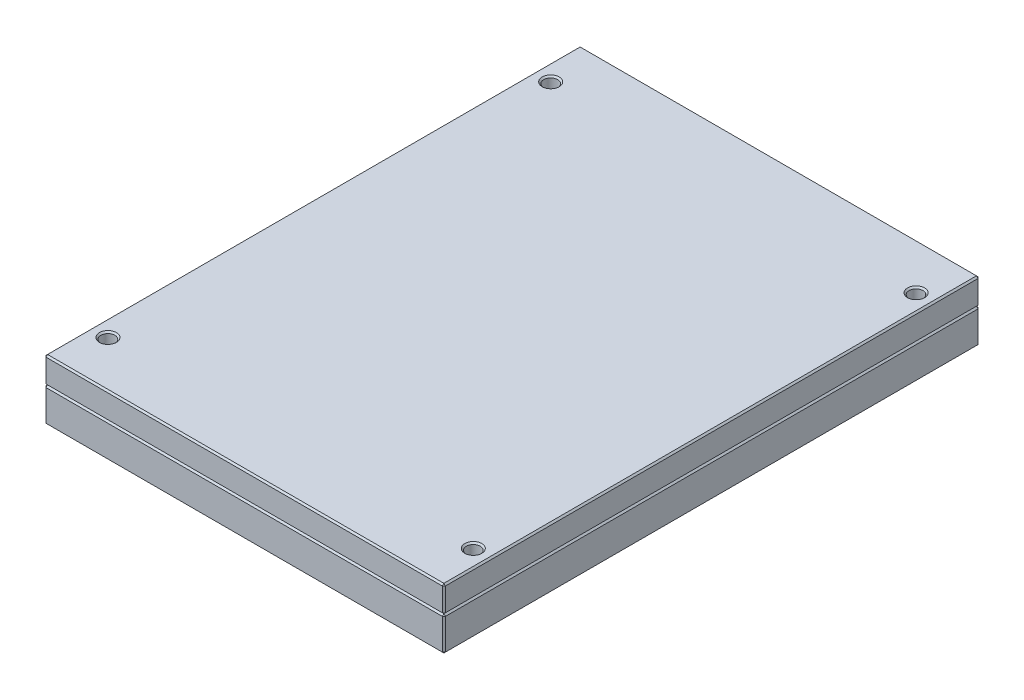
ISO-10303-21;
HEADER;
FILE_DESCRIPTION(('STEP AP214'),'2;1');
FILE_NAME('part.step','',(''),(''),'','','');
FILE_SCHEMA(('AUTOMOTIVE_DESIGN { 1 0 10303 214 1 1 1 1 }'));
ENDSEC;
DATA;
#1=APPLICATION_CONTEXT('core data for automotive mechanical design processes');
#2=APPLICATION_PROTOCOL_DEFINITION('international standard','automotive_design',2000,#1);
#3=PRODUCT_CONTEXT('',#1,'mechanical');
#4=PRODUCT('Part','Part','',(#3));
#5=PRODUCT_RELATED_PRODUCT_CATEGORY('part','',(#4));
#6=PRODUCT_DEFINITION_FORMATION('','',#4);
#7=PRODUCT_DEFINITION_CONTEXT('part definition',#1,'design');
#8=PRODUCT_DEFINITION('design','',#6,#7);
#9=PRODUCT_DEFINITION_SHAPE('','',#8);
#10=(LENGTH_UNIT() NAMED_UNIT(*) SI_UNIT(.MILLI.,.METRE.));
#11=(NAMED_UNIT(*) PLANE_ANGLE_UNIT() SI_UNIT($,.RADIAN.));
#12=(NAMED_UNIT(*) SI_UNIT($,.STERADIAN.) SOLID_ANGLE_UNIT());
#13=UNCERTAINTY_MEASURE_WITH_UNIT(LENGTH_MEASURE(1.E-05),#10,'distance_accuracy_value','');
#14=(GEOMETRIC_REPRESENTATION_CONTEXT(3) GLOBAL_UNCERTAINTY_ASSIGNED_CONTEXT((#13)) GLOBAL_UNIT_ASSIGNED_CONTEXT((#10,
#11,#12)) REPRESENTATION_CONTEXT('',''));
#15=CARTESIAN_POINT('',(0.,0.,0.));
#16=DIRECTION('',(0.,0.,1.));
#17=DIRECTION('',(1.,0.,0.));
#18=AXIS2_PLACEMENT_3D('',#15,#16,#17);
#19=CARTESIAN_POINT('',(-129.,39.,173.));
#20=DIRECTION('',(1.,0.,0.));
#21=DIRECTION('',(0.,0.,-1.));
#22=AXIS2_PLACEMENT_3D('',#19,#20,#21);
#23=PLANE('',#22);
#24=DIRECTION('',(0.,0.,1.));
#25=VECTOR('',#24,1.);
#26=CARTESIAN_POINT('',(-129.,23.,173.));
#27=LINE('',#26,#25);
#28=CARTESIAN_POINT('',(-129.,23.,-172.));
#29=VERTEX_POINT('',#28);
#30=CARTESIAN_POINT('',(-129.,23.,172.));
#31=VERTEX_POINT('',#30);
#32=EDGE_CURVE('P0_E220',#29,#31,#27,.T.);
#33=ORIENTED_EDGE('',*,*,#32,.T.);
#34=DIRECTION('',(0.,1.,0.));
#35=VECTOR('',#34,1.);
#36=CARTESIAN_POINT('',(-129.,39.,172.));
#37=LINE('',#36,#35);
#38=CARTESIAN_POINT('',(-129.,38.,172.));
#39=VERTEX_POINT('',#38);
#40=EDGE_CURVE('P0_E222',#31,#39,#37,.T.);
#41=ORIENTED_EDGE('',*,*,#40,.T.);
#42=DIRECTION('',(0.,0.,-1.));
#43=VECTOR('',#42,1.);
#44=CARTESIAN_POINT('',(-129.,38.,-173.));
#45=LINE('',#44,#43);
#46=CARTESIAN_POINT('',(-129.,38.,-172.));
#47=VERTEX_POINT('',#46);
#48=EDGE_CURVE('P0_E216',#39,#47,#45,.T.);
#49=ORIENTED_EDGE('',*,*,#48,.T.);
#50=DIRECTION('',(0.,-1.,0.));
#51=VECTOR('',#50,1.);
#52=CARTESIAN_POINT('',(-129.,39.,-172.));
#53=LINE('',#52,#51);
#54=EDGE_CURVE('P0_E218',#47,#29,#53,.T.);
#55=ORIENTED_EDGE('',*,*,#54,.T.);
#56=EDGE_LOOP('',(#33,#41,#49,#55));
#57=FACE_BOUND('',#56,.T.);
#58=ADVANCED_FACE('P0_F16',(#57),#23,.F.);
#59=CARTESIAN_POINT('',(129.,39.,173.));
#60=DIRECTION('',(0.,0.,-1.));
#61=DIRECTION('',(-1.,0.,0.));
#62=AXIS2_PLACEMENT_3D('',#59,#60,#61);
#63=PLANE('',#62);
#64=DIRECTION('',(0.,-1.,0.));
#65=VECTOR('',#64,1.);
#66=CARTESIAN_POINT('',(-128.,39.,173.));
#67=LINE('',#66,#65);
#68=CARTESIAN_POINT('',(-128.,38.,173.));
#69=VERTEX_POINT('',#68);
#70=CARTESIAN_POINT('',(-128.,23.,173.));
#71=VERTEX_POINT('',#70);
#72=EDGE_CURVE('P0_E116',#69,#71,#67,.T.);
#73=ORIENTED_EDGE('',*,*,#72,.T.);
#74=DIRECTION('',(1.,0.,0.));
#75=VECTOR('',#74,1.);
#76=CARTESIAN_POINT('',(129.,23.,173.));
#77=LINE('',#76,#75);
#78=CARTESIAN_POINT('',(128.,23.,173.));
#79=VERTEX_POINT('',#78);
#80=EDGE_CURVE('P0_E112',#71,#79,#77,.T.);
#81=ORIENTED_EDGE('',*,*,#80,.T.);
#82=DIRECTION('',(0.,1.,0.));
#83=VECTOR('',#82,1.);
#84=CARTESIAN_POINT('',(128.,39.,173.));
#85=LINE('',#84,#83);
#86=CARTESIAN_POINT('',(128.,38.,173.));
#87=VERTEX_POINT('',#86);
#88=EDGE_CURVE('P0_E106',#79,#87,#85,.T.);
#89=ORIENTED_EDGE('',*,*,#88,.T.);
#90=DIRECTION('',(-1.,0.,0.));
#91=VECTOR('',#90,1.);
#92=CARTESIAN_POINT('',(-129.,38.,173.));
#93=LINE('',#92,#91);
#94=EDGE_CURVE('P0_E109',#87,#69,#93,.T.);
#95=ORIENTED_EDGE('',*,*,#94,.T.);
#96=EDGE_LOOP('',(#73,#81,#89,#95));
#97=FACE_BOUND('',#96,.T.);
#98=ADVANCED_FACE('P0_F108',(#97),#63,.F.);
#99=CARTESIAN_POINT('',(129.,39.,173.));
#100=DIRECTION('',(-1.,0.,0.));
#101=DIRECTION('',(0.,0.,1.));
#102=AXIS2_PLACEMENT_3D('',#99,#100,#101);
#103=PLANE('',#102);
#104=DIRECTION('',(0.,0.,1.));
#105=VECTOR('',#104,1.);
#106=CARTESIAN_POINT('',(129.,38.,173.));
#107=LINE('',#106,#105);
#108=CARTESIAN_POINT('',(129.,38.,-172.));
#109=VERTEX_POINT('',#108);
#110=CARTESIAN_POINT('',(129.,38.,172.));
#111=VERTEX_POINT('',#110);
#112=EDGE_CURVE('P0_E234',#109,#111,#107,.T.);
#113=ORIENTED_EDGE('',*,*,#112,.T.);
#114=DIRECTION('',(0.,-1.,0.));
#115=VECTOR('',#114,1.);
#116=CARTESIAN_POINT('',(129.,39.,172.));
#117=LINE('',#116,#115);
#118=CARTESIAN_POINT('',(129.,23.,172.));
#119=VERTEX_POINT('',#118);
#120=EDGE_CURVE('P0_E139',#111,#119,#117,.T.);
#121=ORIENTED_EDGE('',*,*,#120,.T.);
#122=DIRECTION('',(0.,0.,-1.));
#123=VECTOR('',#122,1.);
#124=CARTESIAN_POINT('',(129.,23.,173.));
#125=LINE('',#124,#123);
#126=CARTESIAN_POINT('',(129.,23.,-172.));
#127=VERTEX_POINT('',#126);
#128=EDGE_CURVE('P0_E238',#119,#127,#125,.T.);
#129=ORIENTED_EDGE('',*,*,#128,.T.);
#130=DIRECTION('',(0.,1.,0.));
#131=VECTOR('',#130,1.);
#132=CARTESIAN_POINT('',(129.,39.,-172.));
#133=LINE('',#132,#131);
#134=EDGE_CURVE('P0_E236',#127,#109,#133,.T.);
#135=ORIENTED_EDGE('',*,*,#134,.T.);
#136=EDGE_LOOP('',(#113,#121,#129,#135));
#137=FACE_BOUND('',#136,.T.);
#138=ADVANCED_FACE('P0_F307',(#137),#103,.F.);
#139=CARTESIAN_POINT('',(129.,39.,-173.));
#140=DIRECTION('',(0.,0.,1.));
#141=DIRECTION('',(1.,0.,0.));
#142=AXIS2_PLACEMENT_3D('',#139,#140,#141);
#143=PLANE('',#142);
#144=DIRECTION('',(-1.,0.,0.));
#145=VECTOR('',#144,1.);
#146=CARTESIAN_POINT('',(129.,23.,-173.));
#147=LINE('',#146,#145);
#148=CARTESIAN_POINT('',(128.,23.,-173.));
#149=VERTEX_POINT('',#148);
#150=CARTESIAN_POINT('',(-128.,23.,-173.));
#151=VERTEX_POINT('',#150);
#152=EDGE_CURVE('P0_E229',#149,#151,#147,.T.);
#153=ORIENTED_EDGE('',*,*,#152,.T.);
#154=DIRECTION('',(0.,1.,0.));
#155=VECTOR('',#154,1.);
#156=CARTESIAN_POINT('',(-128.,39.,-173.));
#157=LINE('',#156,#155);
#158=CARTESIAN_POINT('',(-128.,38.,-173.));
#159=VERTEX_POINT('',#158);
#160=EDGE_CURVE('P0_E231',#151,#159,#157,.T.);
#161=ORIENTED_EDGE('',*,*,#160,.T.);
#162=DIRECTION('',(1.,0.,0.));
#163=VECTOR('',#162,1.);
#164=CARTESIAN_POINT('',(129.,38.,-173.));
#165=LINE('',#164,#163);
#166=CARTESIAN_POINT('',(128.,38.,-173.));
#167=VERTEX_POINT('',#166);
#168=EDGE_CURVE('P0_E225',#159,#167,#165,.T.);
#169=ORIENTED_EDGE('',*,*,#168,.T.);
#170=DIRECTION('',(0.,-1.,0.));
#171=VECTOR('',#170,1.);
#172=CARTESIAN_POINT('',(128.,39.,-173.));
#173=LINE('',#172,#171);
#174=EDGE_CURVE('P0_E227',#167,#149,#173,.T.);
#175=ORIENTED_EDGE('',*,*,#174,.T.);
#176=EDGE_LOOP('',(#153,#161,#169,#175));
#177=FACE_BOUND('',#176,.T.);
#178=ADVANCED_FACE('P0_F318',(#177),#143,.F.);
#179=CARTESIAN_POINT('',(0.,39.,0.));
#180=DIRECTION('',(0.,1.,0.));
#181=DIRECTION('',(0.,0.,1.));
#182=AXIS2_PLACEMENT_3D('',#179,#180,#181);
#183=PLANE('',#182);
#184=DIRECTION('',(0.,0.,-1.));
#185=VECTOR('',#184,1.);
#186=CARTESIAN_POINT('',(128.,39.,-173.));
#187=LINE('',#186,#185);
#188=CARTESIAN_POINT('',(128.,39.,172.));
#189=VERTEX_POINT('',#188);
#190=CARTESIAN_POINT('',(128.,39.,-172.));
#191=VERTEX_POINT('',#190);
#192=EDGE_CURVE('P0_E33',#189,#191,#187,.T.);
#193=ORIENTED_EDGE('',*,*,#192,.T.);
#194=DIRECTION('',(-1.,0.,0.));
#195=VECTOR('',#194,1.);
#196=CARTESIAN_POINT('',(-129.,39.,-172.));
#197=LINE('',#196,#195);
#198=CARTESIAN_POINT('',(-128.,39.,-172.));
#199=VERTEX_POINT('',#198);
#200=EDGE_CURVE('P0_E257',#191,#199,#197,.T.);
#201=ORIENTED_EDGE('',*,*,#200,.T.);
#202=DIRECTION('',(0.,0.,1.));
#203=VECTOR('',#202,1.);
#204=CARTESIAN_POINT('',(-128.,39.,173.));
#205=LINE('',#204,#203);
#206=CARTESIAN_POINT('',(-128.,39.,172.));
#207=VERTEX_POINT('',#206);
#208=EDGE_CURVE('P0_E253',#199,#207,#205,.T.);
#209=ORIENTED_EDGE('',*,*,#208,.T.);
#210=DIRECTION('',(1.,0.,0.));
#211=VECTOR('',#210,1.);
#212=CARTESIAN_POINT('',(129.,39.,172.));
#213=LINE('',#212,#211);
#214=EDGE_CURVE('P0_E38',#207,#189,#213,.T.);
#215=ORIENTED_EDGE('',*,*,#214,.T.);
#216=EDGE_LOOP('',(#193,#201,#209,#215));
#217=FACE_BOUND('',#216,.T.);
#218=CARTESIAN_POINT('',(118.,39.,143.));
#219=DIRECTION('',(0.,1.,0.));
#220=DIRECTION('',(0.,0.,1.));
#221=AXIS2_PLACEMENT_3D('',#218,#219,#220);
#222=CIRCLE('',#221,5.5);
#223=CARTESIAN_POINT('',(118.,39.,148.5));
#224=VERTEX_POINT('',#223);
#225=EDGE_CURVE('P0_E250',#224,#224,#222,.F.);
#226=ORIENTED_EDGE('',*,*,#225,.T.);
#227=EDGE_LOOP('',(#226));
#228=FACE_BOUND('',#227,.T.);
#229=CARTESIAN_POINT('',(-118.,39.,143.));
#230=DIRECTION('',(0.,1.,0.));
#231=DIRECTION('',(0.,0.,1.));
#232=AXIS2_PLACEMENT_3D('',#229,#230,#231);
#233=CIRCLE('',#232,5.5);
#234=CARTESIAN_POINT('',(-118.,39.,148.5));
#235=VERTEX_POINT('',#234);
#236=EDGE_CURVE('P0_E247',#235,#235,#233,.F.);
#237=ORIENTED_EDGE('',*,*,#236,.T.);
#238=EDGE_LOOP('',(#237));
#239=FACE_BOUND('',#238,.T.);
#240=CARTESIAN_POINT('',(118.,39.,-143.));
#241=DIRECTION('',(0.,1.,0.));
#242=DIRECTION('',(0.,0.,1.));
#243=AXIS2_PLACEMENT_3D('',#240,#241,#242);
#244=CIRCLE('',#243,5.5);
#245=CARTESIAN_POINT('',(118.,39.,-137.5));
#246=VERTEX_POINT('',#245);
#247=EDGE_CURVE('P0_E244',#246,#246,#244,.F.);
#248=ORIENTED_EDGE('',*,*,#247,.T.);
#249=EDGE_LOOP('',(#248));
#250=FACE_BOUND('',#249,.T.);
#251=CARTESIAN_POINT('',(-118.,39.,-143.));
#252=DIRECTION('',(0.,1.,0.));
#253=DIRECTION('',(0.,0.,1.));
#254=AXIS2_PLACEMENT_3D('',#251,#252,#253);
#255=CIRCLE('',#254,5.5);
#256=CARTESIAN_POINT('',(-118.,39.,-137.5));
#257=VERTEX_POINT('',#256);
#258=EDGE_CURVE('P0_E241',#257,#257,#255,.F.);
#259=ORIENTED_EDGE('',*,*,#258,.T.);
#260=EDGE_LOOP('',(#259));
#261=FACE_BOUND('',#260,.T.);
#262=ADVANCED_FACE('P0_F335',(#217,#228,#239,#250,#261),#183,.T.);
#263=CARTESIAN_POINT('',(0.,22.,0.));
#264=DIRECTION('',(0.,1.,0.));
#265=DIRECTION('',(0.,0.,1.));
#266=AXIS2_PLACEMENT_3D('',#263,#264,#265);
#267=PLANE('',#266);
#268=DIRECTION('',(0.,0.,1.));
#269=VECTOR('',#268,1.);
#270=CARTESIAN_POINT('',(128.,22.,0.));
#271=LINE('',#270,#269);
#272=CARTESIAN_POINT('',(128.,22.,-172.));
#273=VERTEX_POINT('',#272);
#274=CARTESIAN_POINT('',(128.,22.,172.));
#275=VERTEX_POINT('',#274);
#276=EDGE_CURVE('P0_E207',#273,#275,#271,.T.);
#277=ORIENTED_EDGE('',*,*,#276,.T.);
#278=DIRECTION('',(-1.,0.,0.));
#279=VECTOR('',#278,1.);
#280=CARTESIAN_POINT('',(0.,22.,172.));
#281=LINE('',#280,#279);
#282=CARTESIAN_POINT('',(-128.,22.,172.));
#283=VERTEX_POINT('',#282);
#284=EDGE_CURVE('P0_E213',#275,#283,#281,.T.);
#285=ORIENTED_EDGE('',*,*,#284,.T.);
#286=DIRECTION('',(0.,0.,-1.));
#287=VECTOR('',#286,1.);
#288=CARTESIAN_POINT('',(-128.,22.,0.));
#289=LINE('',#288,#287);
#290=CARTESIAN_POINT('',(-128.,22.,-172.));
#291=VERTEX_POINT('',#290);
#292=EDGE_CURVE('P0_E211',#283,#291,#289,.T.);
#293=ORIENTED_EDGE('',*,*,#292,.T.);
#294=DIRECTION('',(1.,0.,0.));
#295=VECTOR('',#294,1.);
#296=CARTESIAN_POINT('',(0.,22.,-172.));
#297=LINE('',#296,#295);
#298=EDGE_CURVE('P0_E209',#291,#273,#297,.T.);
#299=ORIENTED_EDGE('',*,*,#298,.T.);
#300=EDGE_LOOP('',(#277,#285,#293,#299));
#301=FACE_BOUND('',#300,.T.);
#302=CARTESIAN_POINT('',(-118.,22.,-143.));
#303=DIRECTION('',(0.,1.,0.));
#304=DIRECTION('',(0.,0.,1.));
#305=AXIS2_PLACEMENT_3D('',#302,#303,#304);
#306=CIRCLE('',#305,4.5);
#307=CARTESIAN_POINT('',(-118.,22.,-138.5));
#308=VERTEX_POINT('',#307);
#309=EDGE_CURVE('P0_E127',#308,#308,#306,.T.);
#310=ORIENTED_EDGE('',*,*,#309,.T.);
#311=EDGE_LOOP('',(#310));
#312=FACE_BOUND('',#311,.T.);
#313=CARTESIAN_POINT('',(118.,22.,-143.));
#314=DIRECTION('',(0.,1.,0.));
#315=DIRECTION('',(0.,0.,1.));
#316=AXIS2_PLACEMENT_3D('',#313,#314,#315);
#317=CIRCLE('',#316,4.5);
#318=CARTESIAN_POINT('',(118.,22.,-138.5));
#319=VERTEX_POINT('',#318);
#320=EDGE_CURVE('P0_E198',#319,#319,#317,.T.);
#321=ORIENTED_EDGE('',*,*,#320,.T.);
#322=EDGE_LOOP('',(#321));
#323=FACE_BOUND('',#322,.T.);
#324=CARTESIAN_POINT('',(-118.,22.,143.));
#325=DIRECTION('',(0.,1.,0.));
#326=DIRECTION('',(0.,0.,1.));
#327=AXIS2_PLACEMENT_3D('',#324,#325,#326);
#328=CIRCLE('',#327,4.5);
#329=CARTESIAN_POINT('',(-118.,22.,147.5));
#330=VERTEX_POINT('',#329);
#331=EDGE_CURVE('P0_E193',#330,#330,#328,.T.);
#332=ORIENTED_EDGE('',*,*,#331,.T.);
#333=EDGE_LOOP('',(#332));
#334=FACE_BOUND('',#333,.T.);
#335=CARTESIAN_POINT('',(118.,22.,143.));
#336=DIRECTION('',(0.,1.,0.));
#337=DIRECTION('',(0.,0.,1.));
#338=AXIS2_PLACEMENT_3D('',#335,#336,#337);
#339=CIRCLE('',#338,4.5);
#340=CARTESIAN_POINT('',(118.,22.,147.5));
#341=VERTEX_POINT('',#340);
#342=EDGE_CURVE('P0_E186',#341,#341,#339,.T.);
#343=ORIENTED_EDGE('',*,*,#342,.T.);
#344=EDGE_LOOP('',(#343));
#345=FACE_BOUND('',#344,.T.);
#346=ADVANCED_FACE('P0_F292',(#301,#312,#323,#334,#345),#267,.F.);
#347=CARTESIAN_POINT('',(118.,0.,143.));
#348=DIRECTION('',(0.,1.,0.));
#349=DIRECTION('',(0.,0.,1.));
#350=AXIS2_PLACEMENT_3D('',#347,#348,#349);
#351=CYLINDRICAL_SURFACE('',#350,4.5);
#352=CARTESIAN_POINT('',(118.,38.,143.));
#353=DIRECTION('',(0.,1.,0.));
#354=DIRECTION('',(0.,0.,1.));
#355=AXIS2_PLACEMENT_3D('',#352,#353,#354);
#356=CIRCLE('',#355,4.5);
#357=CARTESIAN_POINT('',(118.,38.,147.5));
#358=VERTEX_POINT('',#357);
#359=EDGE_CURVE('P0_E259',#358,#358,#356,.T.);
#360=ORIENTED_EDGE('',*,*,#359,.T.);
#361=EDGE_LOOP('',(#360));
#362=FACE_BOUND('',#361,.T.);
#363=ORIENTED_EDGE('',*,*,#342,.F.);
#364=EDGE_LOOP('',(#363));
#365=FACE_BOUND('',#364,.T.);
#366=ADVANCED_FACE('P0_F427',(#362,#365),#351,.F.);
#367=CARTESIAN_POINT('',(-118.,0.,143.));
#368=DIRECTION('',(0.,1.,0.));
#369=DIRECTION('',(0.,0.,1.));
#370=AXIS2_PLACEMENT_3D('',#367,#368,#369);
#371=CYLINDRICAL_SURFACE('',#370,4.5);
#372=CARTESIAN_POINT('',(-118.,38.,143.));
#373=DIRECTION('',(0.,1.,0.));
#374=DIRECTION('',(0.,0.,1.));
#375=AXIS2_PLACEMENT_3D('',#372,#373,#374);
#376=CIRCLE('',#375,4.5);
#377=CARTESIAN_POINT('',(-118.,38.,147.5));
#378=VERTEX_POINT('',#377);
#379=EDGE_CURVE('P0_E262',#378,#378,#376,.T.);
#380=ORIENTED_EDGE('',*,*,#379,.T.);
#381=EDGE_LOOP('',(#380));
#382=FACE_BOUND('',#381,.T.);
#383=ORIENTED_EDGE('',*,*,#331,.F.);
#384=EDGE_LOOP('',(#383));
#385=FACE_BOUND('',#384,.T.);
#386=ADVANCED_FACE('P0_F421',(#382,#385),#371,.F.);
#387=CARTESIAN_POINT('',(118.,0.,-143.));
#388=DIRECTION('',(0.,1.,0.));
#389=DIRECTION('',(0.,0.,1.));
#390=AXIS2_PLACEMENT_3D('',#387,#388,#389);
#391=CYLINDRICAL_SURFACE('',#390,4.5);
#392=CARTESIAN_POINT('',(118.,38.,-143.));
#393=DIRECTION('',(0.,1.,0.));
#394=DIRECTION('',(0.,0.,1.));
#395=AXIS2_PLACEMENT_3D('',#392,#393,#394);
#396=CIRCLE('',#395,4.5);
#397=CARTESIAN_POINT('',(118.,38.,-138.5));
#398=VERTEX_POINT('',#397);
#399=EDGE_CURVE('P0_E25',#398,#398,#396,.T.);
#400=ORIENTED_EDGE('',*,*,#399,.T.);
#401=EDGE_LOOP('',(#400));
#402=FACE_BOUND('',#401,.T.);
#403=ORIENTED_EDGE('',*,*,#320,.F.);
#404=EDGE_LOOP('',(#403));
#405=FACE_BOUND('',#404,.T.);
#406=ADVANCED_FACE('P0_F418',(#402,#405),#391,.F.);
#407=CARTESIAN_POINT('',(-118.,0.,-143.));
#408=DIRECTION('',(0.,1.,0.));
#409=DIRECTION('',(0.,0.,1.));
#410=AXIS2_PLACEMENT_3D('',#407,#408,#409);
#411=CYLINDRICAL_SURFACE('',#410,4.5);
#412=CARTESIAN_POINT('',(-118.,38.,-143.));
#413=DIRECTION('',(0.,1.,0.));
#414=DIRECTION('',(0.,0.,1.));
#415=AXIS2_PLACEMENT_3D('',#412,#413,#414);
#416=CIRCLE('',#415,4.5);
#417=CARTESIAN_POINT('',(-118.,38.,-138.5));
#418=VERTEX_POINT('',#417);
#419=EDGE_CURVE('P0_E10',#418,#418,#416,.T.);
#420=ORIENTED_EDGE('',*,*,#419,.T.);
#421=EDGE_LOOP('',(#420));
#422=FACE_BOUND('',#421,.T.);
#423=ORIENTED_EDGE('',*,*,#309,.F.);
#424=EDGE_LOOP('',(#423));
#425=FACE_BOUND('',#424,.T.);
#426=ADVANCED_FACE('P0_F399',(#422,#425),#411,.F.);
#427=CARTESIAN_POINT('',(0.,39.,-172.));
#428=DIRECTION('',(0.,0.707106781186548,-0.707106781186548));
#429=DIRECTION('',(1.,0.,0.));
#430=AXIS2_PLACEMENT_3D('',#427,#428,#429);
#431=PLANE('',#430);
#432=DIRECTION('',(0.,-0.707106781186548,-0.707106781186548));
#433=VECTOR('',#432,1.);
#434=CARTESIAN_POINT('',(-128.,38.,-173.));
#435=LINE('',#434,#433);
#436=EDGE_CURVE('P0_E20',#199,#159,#435,.T.);
#437=ORIENTED_EDGE('',*,*,#436,.F.);
#438=ORIENTED_EDGE('',*,*,#200,.F.);
#439=DIRECTION('',(0.,0.707106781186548,0.707106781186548));
#440=VECTOR('',#439,1.);
#441=CARTESIAN_POINT('',(128.,38.5,-172.5));
#442=LINE('',#441,#440);
#443=EDGE_CURVE('P0_E179',#167,#191,#442,.T.);
#444=ORIENTED_EDGE('',*,*,#443,.F.);
#445=ORIENTED_EDGE('',*,*,#168,.F.);
#446=EDGE_LOOP('',(#437,#438,#444,#445));
#447=FACE_BOUND('',#446,.T.);
#448=ADVANCED_FACE('P0_F334',(#447),#431,.T.);
#449=CARTESIAN_POINT('',(-128.,38.,-173.));
#450=DIRECTION('',(-0.577350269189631,0.577350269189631,-0.577350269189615));
#451=DIRECTION('',(-0.707106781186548,-0.707106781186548,0.));
#452=AXIS2_PLACEMENT_3D('',#449,#450,#451);
#453=PLANE('',#452);
#454=DIRECTION('',(0.707106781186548,0.707106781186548,0.));
#455=VECTOR('',#454,1.);
#456=CARTESIAN_POINT('',(-128.5,38.5,-172.));
#457=LINE('',#456,#455);
#458=EDGE_CURVE('P0_E175',#199,#47,#457,.F.);
#459=ORIENTED_EDGE('',*,*,#458,.F.);
#460=ORIENTED_EDGE('',*,*,#436,.T.);
#461=DIRECTION('',(0.707106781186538,0.,-0.707106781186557));
#462=VECTOR('',#461,1.);
#463=CARTESIAN_POINT('',(-128.,38.,-173.));
#464=LINE('',#463,#462);
#465=EDGE_CURVE('P0_E178',#47,#159,#464,.T.);
#466=ORIENTED_EDGE('',*,*,#465,.F.);
#467=EDGE_LOOP('',(#459,#460,#466));
#468=FACE_BOUND('',#467,.T.);
#469=ADVANCED_FACE('P0_F330',(#468),#453,.T.);
#470=CARTESIAN_POINT('',(129.,38.,-172.));
#471=DIRECTION('',(0.577350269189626,0.577350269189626,-0.577350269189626));
#472=DIRECTION('',(-0.707106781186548,0.,-0.707106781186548));
#473=AXIS2_PLACEMENT_3D('',#470,#471,#472);
#474=PLANE('',#473);
#475=DIRECTION('',(0.707106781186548,0.,0.707106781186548));
#476=VECTOR('',#475,1.);
#477=CARTESIAN_POINT('',(129.,38.,-172.));
#478=LINE('',#477,#476);
#479=EDGE_CURVE('P0_E169',#167,#109,#478,.T.);
#480=ORIENTED_EDGE('',*,*,#479,.F.);
#481=ORIENTED_EDGE('',*,*,#443,.T.);
#482=DIRECTION('',(0.707106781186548,-0.707106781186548,0.));
#483=VECTOR('',#482,1.);
#484=CARTESIAN_POINT('',(129.,38.,-172.));
#485=LINE('',#484,#483);
#486=EDGE_CURVE('P0_E172',#109,#191,#485,.F.);
#487=ORIENTED_EDGE('',*,*,#486,.F.);
#488=EDGE_LOOP('',(#480,#481,#487));
#489=FACE_BOUND('',#488,.T.);
#490=ADVANCED_FACE('P0_F311',(#489),#474,.T.);
#491=CARTESIAN_POINT('',(-129.,39.,-172.));
#492=DIRECTION('',(0.707106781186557,0.,0.707106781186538));
#493=DIRECTION('',(0.,-1.,0.));
#494=AXIS2_PLACEMENT_3D('',#491,#492,#493);
#495=PLANE('',#494);
#496=ORIENTED_EDGE('',*,*,#465,.T.);
#497=ORIENTED_EDGE('',*,*,#160,.F.);
#498=DIRECTION('',(-0.707106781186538,0.,0.707106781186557));
#499=VECTOR('',#498,1.);
#500=CARTESIAN_POINT('',(-128.5,23.,-172.5));
#501=LINE('',#500,#499);
#502=EDGE_CURVE('P0_E163',#29,#151,#501,.F.);
#503=ORIENTED_EDGE('',*,*,#502,.F.);
#504=ORIENTED_EDGE('',*,*,#54,.F.);
#505=EDGE_LOOP('',(#496,#497,#503,#504));
#506=FACE_BOUND('',#505,.T.);
#507=ADVANCED_FACE('P0_F329',(#506),#495,.F.);
#508=CARTESIAN_POINT('',(-128.,39.,0.));
#509=DIRECTION('',(-0.707106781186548,0.707106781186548,0.));
#510=DIRECTION('',(0.,0.,-1.));
#511=AXIS2_PLACEMENT_3D('',#508,#509,#510);
#512=PLANE('',#511);
#513=ORIENTED_EDGE('',*,*,#458,.T.);
#514=ORIENTED_EDGE('',*,*,#48,.F.);
#515=DIRECTION('',(-0.707106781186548,-0.707106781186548,0.));
#516=VECTOR('',#515,1.);
#517=CARTESIAN_POINT('',(-129.,38.,172.));
#518=LINE('',#517,#516);
#519=EDGE_CURVE('P0_E160',#207,#39,#518,.T.);
#520=ORIENTED_EDGE('',*,*,#519,.F.);
#521=ORIENTED_EDGE('',*,*,#208,.F.);
#522=EDGE_LOOP('',(#513,#514,#520,#521));
#523=FACE_BOUND('',#522,.T.);
#524=ADVANCED_FACE('P0_F338',(#523),#512,.T.);
#525=CARTESIAN_POINT('',(0.,39.,172.));
#526=DIRECTION('',(0.,0.707106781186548,0.707106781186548));
#527=DIRECTION('',(-1.,0.,0.));
#528=AXIS2_PLACEMENT_3D('',#525,#526,#527);
#529=PLANE('',#528);
#530=DIRECTION('',(0.,-0.707106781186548,0.707106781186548));
#531=VECTOR('',#530,1.);
#532=CARTESIAN_POINT('',(128.,38.,173.));
#533=LINE('',#532,#531);
#534=EDGE_CURVE('P0_E122',#189,#87,#533,.T.);
#535=ORIENTED_EDGE('',*,*,#534,.F.);
#536=ORIENTED_EDGE('',*,*,#214,.F.);
#537=DIRECTION('',(0.,0.707106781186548,-0.707106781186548));
#538=VECTOR('',#537,1.);
#539=CARTESIAN_POINT('',(-128.,38.5,172.5));
#540=LINE('',#539,#538);
#541=EDGE_CURVE('P0_E125',#69,#207,#540,.T.);
#542=ORIENTED_EDGE('',*,*,#541,.F.);
#543=ORIENTED_EDGE('',*,*,#94,.F.);
#544=EDGE_LOOP('',(#535,#536,#542,#543));
#545=FACE_BOUND('',#544,.T.);
#546=ADVANCED_FACE('P0_F121',(#545),#529,.T.);
#547=CARTESIAN_POINT('',(128.,39.,0.));
#548=DIRECTION('',(0.707106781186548,0.707106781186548,0.));
#549=DIRECTION('',(0.,0.,1.));
#550=AXIS2_PLACEMENT_3D('',#547,#548,#549);
#551=PLANE('',#550);
#552=ORIENTED_EDGE('',*,*,#486,.T.);
#553=ORIENTED_EDGE('',*,*,#192,.F.);
#554=DIRECTION('',(-0.707106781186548,0.707106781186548,0.));
#555=VECTOR('',#554,1.);
#556=CARTESIAN_POINT('',(128.5,38.5,172.));
#557=LINE('',#556,#555);
#558=EDGE_CURVE('P0_E135',#111,#189,#557,.T.);
#559=ORIENTED_EDGE('',*,*,#558,.F.);
#560=ORIENTED_EDGE('',*,*,#112,.F.);
#561=EDGE_LOOP('',(#552,#553,#559,#560));
#562=FACE_BOUND('',#561,.T.);
#563=ADVANCED_FACE('P0_F310',(#562),#551,.T.);
#564=CARTESIAN_POINT('',(128.,39.,-173.));
#565=DIRECTION('',(-0.707106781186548,0.,0.707106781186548));
#566=DIRECTION('',(0.,-1.,0.));
#567=AXIS2_PLACEMENT_3D('',#564,#565,#566);
#568=PLANE('',#567);
#569=ORIENTED_EDGE('',*,*,#479,.T.);
#570=ORIENTED_EDGE('',*,*,#134,.F.);
#571=DIRECTION('',(-0.707106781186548,0.,-0.707106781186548));
#572=VECTOR('',#571,1.);
#573=CARTESIAN_POINT('',(128.5,23.,-172.5));
#574=LINE('',#573,#572);
#575=EDGE_CURVE('P0_E155',#149,#127,#574,.F.);
#576=ORIENTED_EDGE('',*,*,#575,.F.);
#577=ORIENTED_EDGE('',*,*,#174,.F.);
#578=EDGE_LOOP('',(#569,#570,#576,#577));
#579=FACE_BOUND('',#578,.T.);
#580=ADVANCED_FACE('P0_F315',(#579),#568,.F.);
#581=CARTESIAN_POINT('',(129.,23.,-173.));
#582=DIRECTION('',(0.,0.707106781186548,0.707106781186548));
#583=DIRECTION('',(-1.,0.,0.));
#584=AXIS2_PLACEMENT_3D('',#581,#582,#583);
#585=PLANE('',#584);
#586=DIRECTION('',(0.,0.707106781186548,-0.707106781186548));
#587=VECTOR('',#586,1.);
#588=CARTESIAN_POINT('',(-128.,22.,-172.));
#589=LINE('',#588,#587);
#590=EDGE_CURVE('P0_E166',#151,#291,#589,.F.);
#591=ORIENTED_EDGE('',*,*,#590,.F.);
#592=ORIENTED_EDGE('',*,*,#152,.F.);
#593=DIRECTION('',(0.,-0.707106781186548,0.707106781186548));
#594=VECTOR('',#593,1.);
#595=CARTESIAN_POINT('',(128.,22.,-172.));
#596=LINE('',#595,#594);
#597=EDGE_CURVE('P0_E152',#273,#149,#596,.F.);
#598=ORIENTED_EDGE('',*,*,#597,.F.);
#599=ORIENTED_EDGE('',*,*,#298,.F.);
#600=EDGE_LOOP('',(#591,#592,#598,#599));
#601=FACE_BOUND('',#600,.T.);
#602=ADVANCED_FACE('P0_F323',(#601),#585,.F.);
#603=CARTESIAN_POINT('',(-128.,22.,-172.));
#604=DIRECTION('',(-0.577350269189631,-0.577350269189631,-0.577350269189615));
#605=DIRECTION('',(0.707106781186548,-0.707106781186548,0.));
#606=AXIS2_PLACEMENT_3D('',#603,#604,#605);
#607=PLANE('',#606);
#608=ORIENTED_EDGE('',*,*,#502,.T.);
#609=ORIENTED_EDGE('',*,*,#590,.T.);
#610=DIRECTION('',(0.707106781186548,-0.707106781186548,0.));
#611=VECTOR('',#610,1.);
#612=CARTESIAN_POINT('',(-128.,22.,-172.));
#613=LINE('',#612,#611);
#614=EDGE_CURVE('P0_E143',#29,#291,#613,.T.);
#615=ORIENTED_EDGE('',*,*,#614,.F.);
#616=EDGE_LOOP('',(#608,#609,#615));
#617=FACE_BOUND('',#616,.T.);
#618=ADVANCED_FACE('P0_F326',(#617),#607,.T.);
#619=CARTESIAN_POINT('',(-129.,38.,172.));
#620=DIRECTION('',(-0.577350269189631,0.577350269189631,0.577350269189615));
#621=DIRECTION('',(-0.707106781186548,-0.707106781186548,0.));
#622=AXIS2_PLACEMENT_3D('',#619,#620,#621);
#623=PLANE('',#622);
#624=ORIENTED_EDGE('',*,*,#541,.T.);
#625=ORIENTED_EDGE('',*,*,#519,.T.);
#626=DIRECTION('',(-0.707106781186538,0.,-0.707106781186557));
#627=VECTOR('',#626,1.);
#628=CARTESIAN_POINT('',(-129.,38.,172.));
#629=LINE('',#628,#627);
#630=EDGE_CURVE('P0_E140',#69,#39,#629,.T.);
#631=ORIENTED_EDGE('',*,*,#630,.F.);
#632=EDGE_LOOP('',(#624,#625,#631));
#633=FACE_BOUND('',#632,.T.);
#634=ADVANCED_FACE('P0_F340',(#633),#623,.T.);
#635=CARTESIAN_POINT('',(128.,38.,173.));
#636=DIRECTION('',(0.577350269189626,0.577350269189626,0.577350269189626));
#637=DIRECTION('',(0.707106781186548,0.,-0.707106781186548));
#638=AXIS2_PLACEMENT_3D('',#635,#636,#637);
#639=PLANE('',#638);
#640=ORIENTED_EDGE('',*,*,#558,.T.);
#641=ORIENTED_EDGE('',*,*,#534,.T.);
#642=DIRECTION('',(-0.707106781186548,0.,0.707106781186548));
#643=VECTOR('',#642,1.);
#644=CARTESIAN_POINT('',(128.,38.,173.));
#645=LINE('',#644,#643);
#646=EDGE_CURVE('P0_E132',#111,#87,#645,.T.);
#647=ORIENTED_EDGE('',*,*,#646,.F.);
#648=EDGE_LOOP('',(#640,#641,#647));
#649=FACE_BOUND('',#648,.T.);
#650=ADVANCED_FACE('P0_F131',(#649),#639,.T.);
#651=CARTESIAN_POINT('',(128.,22.,-172.));
#652=DIRECTION('',(0.577350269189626,-0.577350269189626,-0.577350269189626));
#653=DIRECTION('',(-0.707106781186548,0.,-0.707106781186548));
#654=AXIS2_PLACEMENT_3D('',#651,#652,#653);
#655=PLANE('',#654);
#656=ORIENTED_EDGE('',*,*,#597,.T.);
#657=ORIENTED_EDGE('',*,*,#575,.T.);
#658=DIRECTION('',(0.707106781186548,0.707106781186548,0.));
#659=VECTOR('',#658,1.);
#660=CARTESIAN_POINT('',(128.,22.,-172.));
#661=LINE('',#660,#659);
#662=EDGE_CURVE('P0_E141',#273,#127,#661,.T.);
#663=ORIENTED_EDGE('',*,*,#662,.F.);
#664=EDGE_LOOP('',(#656,#657,#663));
#665=FACE_BOUND('',#664,.T.);
#666=ADVANCED_FACE('P0_F371',(#665),#655,.T.);
#667=CARTESIAN_POINT('',(-129.,23.,173.));
#668=DIRECTION('',(0.707106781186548,0.707106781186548,0.));
#669=DIRECTION('',(0.,0.,1.));
#670=AXIS2_PLACEMENT_3D('',#667,#668,#669);
#671=PLANE('',#670);
#672=ORIENTED_EDGE('',*,*,#614,.T.);
#673=ORIENTED_EDGE('',*,*,#292,.F.);
#674=DIRECTION('',(-0.707106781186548,0.707106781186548,0.));
#675=VECTOR('',#674,1.);
#676=CARTESIAN_POINT('',(-128.,22.,172.));
#677=LINE('',#676,#675);
#678=EDGE_CURVE('P0_E146',#31,#283,#677,.F.);
#679=ORIENTED_EDGE('',*,*,#678,.F.);
#680=ORIENTED_EDGE('',*,*,#32,.F.);
#681=EDGE_LOOP('',(#672,#673,#679,#680));
#682=FACE_BOUND('',#681,.T.);
#683=ADVANCED_FACE('P0_F287',(#682),#671,.F.);
#684=CARTESIAN_POINT('',(-128.,39.,173.));
#685=DIRECTION('',(0.707106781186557,0.,-0.707106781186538));
#686=DIRECTION('',(0.,-1.,0.));
#687=AXIS2_PLACEMENT_3D('',#684,#685,#686);
#688=PLANE('',#687);
#689=ORIENTED_EDGE('',*,*,#630,.T.);
#690=ORIENTED_EDGE('',*,*,#40,.F.);
#691=DIRECTION('',(0.707106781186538,0.,0.707106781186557));
#692=VECTOR('',#691,1.);
#693=CARTESIAN_POINT('',(-128.5,23.,172.5));
#694=LINE('',#693,#692);
#695=EDGE_CURVE('P0_E276',#71,#31,#694,.F.);
#696=ORIENTED_EDGE('',*,*,#695,.F.);
#697=ORIENTED_EDGE('',*,*,#72,.F.);
#698=EDGE_LOOP('',(#689,#690,#696,#697));
#699=FACE_BOUND('',#698,.T.);
#700=ADVANCED_FACE('P0_F344',(#699),#688,.F.);
#701=CARTESIAN_POINT('',(129.,39.,172.));
#702=DIRECTION('',(-0.707106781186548,0.,-0.707106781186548));
#703=DIRECTION('',(0.,-1.,0.));
#704=AXIS2_PLACEMENT_3D('',#701,#702,#703);
#705=PLANE('',#704);
#706=ORIENTED_EDGE('',*,*,#646,.T.);
#707=ORIENTED_EDGE('',*,*,#88,.F.);
#708=DIRECTION('',(0.707106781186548,0.,-0.707106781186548));
#709=VECTOR('',#708,1.);
#710=CARTESIAN_POINT('',(128.,23.,173.));
#711=LINE('',#710,#709);
#712=EDGE_CURVE('P0_E273',#119,#79,#711,.F.);
#713=ORIENTED_EDGE('',*,*,#712,.F.);
#714=ORIENTED_EDGE('',*,*,#120,.F.);
#715=EDGE_LOOP('',(#706,#707,#713,#714));
#716=FACE_BOUND('',#715,.T.);
#717=ADVANCED_FACE('P0_F137',(#716),#705,.F.);
#718=CARTESIAN_POINT('',(129.,23.,173.));
#719=DIRECTION('',(-0.707106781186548,0.707106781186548,0.));
#720=DIRECTION('',(0.,0.,-1.));
#721=AXIS2_PLACEMENT_3D('',#718,#719,#720);
#722=PLANE('',#721);
#723=ORIENTED_EDGE('',*,*,#662,.T.);
#724=ORIENTED_EDGE('',*,*,#128,.F.);
#725=DIRECTION('',(-0.707106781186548,-0.707106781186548,0.));
#726=VECTOR('',#725,1.);
#727=CARTESIAN_POINT('',(128.5,22.5,172.));
#728=LINE('',#727,#726);
#729=EDGE_CURVE('P0_E271',#275,#119,#728,.F.);
#730=ORIENTED_EDGE('',*,*,#729,.F.);
#731=ORIENTED_EDGE('',*,*,#276,.F.);
#732=EDGE_LOOP('',(#723,#724,#730,#731));
#733=FACE_BOUND('',#732,.T.);
#734=ADVANCED_FACE('P0_F303',(#733),#722,.F.);
#735=CARTESIAN_POINT('',(-128.,22.,172.));
#736=DIRECTION('',(-0.577350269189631,-0.577350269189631,0.577350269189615));
#737=DIRECTION('',(0.707106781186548,-0.707106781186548,0.));
#738=AXIS2_PLACEMENT_3D('',#735,#736,#737);
#739=PLANE('',#738);
#740=ORIENTED_EDGE('',*,*,#695,.T.);
#741=ORIENTED_EDGE('',*,*,#678,.T.);
#742=DIRECTION('',(0.,-0.707106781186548,-0.707106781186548));
#743=VECTOR('',#742,1.);
#744=CARTESIAN_POINT('',(-128.,22.,172.));
#745=LINE('',#744,#743);
#746=EDGE_CURVE('P0_E269',#71,#283,#745,.T.);
#747=ORIENTED_EDGE('',*,*,#746,.F.);
#748=EDGE_LOOP('',(#740,#741,#747));
#749=FACE_BOUND('',#748,.T.);
#750=ADVANCED_FACE('P0_F283',(#749),#739,.T.);
#751=CARTESIAN_POINT('',(128.,23.,173.));
#752=DIRECTION('',(0.577350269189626,-0.577350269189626,0.577350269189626));
#753=DIRECTION('',(0.707106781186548,0.,-0.707106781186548));
#754=AXIS2_PLACEMENT_3D('',#751,#752,#753);
#755=PLANE('',#754);
#756=ORIENTED_EDGE('',*,*,#729,.T.);
#757=ORIENTED_EDGE('',*,*,#712,.T.);
#758=DIRECTION('',(0.,0.707106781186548,0.707106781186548));
#759=VECTOR('',#758,1.);
#760=CARTESIAN_POINT('',(128.,23.,173.));
#761=LINE('',#760,#759);
#762=EDGE_CURVE('P0_E267',#275,#79,#761,.T.);
#763=ORIENTED_EDGE('',*,*,#762,.F.);
#764=EDGE_LOOP('',(#756,#757,#763));
#765=FACE_BOUND('',#764,.T.);
#766=ADVANCED_FACE('P0_F300',(#765),#755,.T.);
#767=CARTESIAN_POINT('',(129.,23.,173.));
#768=DIRECTION('',(0.,0.707106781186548,-0.707106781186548));
#769=DIRECTION('',(1.,0.,0.));
#770=AXIS2_PLACEMENT_3D('',#767,#768,#769);
#771=PLANE('',#770);
#772=ORIENTED_EDGE('',*,*,#746,.T.);
#773=ORIENTED_EDGE('',*,*,#284,.F.);
#774=ORIENTED_EDGE('',*,*,#762,.T.);
#775=ORIENTED_EDGE('',*,*,#80,.F.);
#776=EDGE_LOOP('',(#772,#773,#774,#775));
#777=FACE_BOUND('',#776,.T.);
#778=ADVANCED_FACE('P0_F298',(#777),#771,.F.);
#779=CARTESIAN_POINT('',(118.,38.,143.));
#780=DIRECTION('',(0.,1.,0.));
#781=DIRECTION('',(0.,0.,1.));
#782=AXIS2_PLACEMENT_3D('',#779,#780,#781);
#783=CONICAL_SURFACE('',#782,4.5,0.785398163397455);
#784=ORIENTED_EDGE('',*,*,#225,.F.);
#785=EDGE_LOOP('',(#784));
#786=FACE_BOUND('',#785,.T.);
#787=ORIENTED_EDGE('',*,*,#359,.F.);
#788=EDGE_LOOP('',(#787));
#789=FACE_BOUND('',#788,.T.);
#790=ADVANCED_FACE('P0_F358',(#786,#789),#783,.F.);
#791=CARTESIAN_POINT('',(-118.,38.,143.));
#792=DIRECTION('',(0.,1.,0.));
#793=DIRECTION('',(0.,0.,1.));
#794=AXIS2_PLACEMENT_3D('',#791,#792,#793);
#795=CONICAL_SURFACE('',#794,4.5,0.785398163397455);
#796=ORIENTED_EDGE('',*,*,#236,.F.);
#797=EDGE_LOOP('',(#796));
#798=FACE_BOUND('',#797,.T.);
#799=ORIENTED_EDGE('',*,*,#379,.F.);
#800=EDGE_LOOP('',(#799));
#801=FACE_BOUND('',#800,.T.);
#802=ADVANCED_FACE('P0_F402',(#798,#801),#795,.F.);
#803=CARTESIAN_POINT('',(118.,38.,-143.));
#804=DIRECTION('',(0.,1.,0.));
#805=DIRECTION('',(0.,0.,1.));
#806=AXIS2_PLACEMENT_3D('',#803,#804,#805);
#807=CONICAL_SURFACE('',#806,4.5,0.785398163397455);
#808=ORIENTED_EDGE('',*,*,#247,.F.);
#809=EDGE_LOOP('',(#808));
#810=FACE_BOUND('',#809,.T.);
#811=ORIENTED_EDGE('',*,*,#399,.F.);
#812=EDGE_LOOP('',(#811));
#813=FACE_BOUND('',#812,.T.);
#814=ADVANCED_FACE('P0_F405',(#810,#813),#807,.F.);
#815=CARTESIAN_POINT('',(-118.,38.,-143.));
#816=DIRECTION('',(0.,1.,0.));
#817=DIRECTION('',(0.,0.,1.));
#818=AXIS2_PLACEMENT_3D('',#815,#816,#817);
#819=CONICAL_SURFACE('',#818,4.5,0.785398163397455);
#820=ORIENTED_EDGE('',*,*,#258,.F.);
#821=EDGE_LOOP('',(#820));
#822=FACE_BOUND('',#821,.T.);
#823=ORIENTED_EDGE('',*,*,#419,.F.);
#824=EDGE_LOOP('',(#823));
#825=FACE_BOUND('',#824,.T.);
#826=ADVANCED_FACE('P0_F18',(#822,#825),#819,.F.);
#827=CLOSED_SHELL('',(#58,#98,#138,#178,#262,#346,#366,#386,#406,#426,#448,#469,#490,#507,#524,
#546,#563,#580,#602,#618,#634,#650,#666,#683,#700,#717,#734,#750,#766,#778,#790,#802,#814,#826));
#828=MANIFOLD_SOLID_BREP('P0_B1',#827);
#829=CARTESIAN_POINT('',(118.,0.,143.));
#830=DIRECTION('',(0.,1.,0.));
#831=DIRECTION('',(0.,0.,1.));
#832=AXIS2_PLACEMENT_3D('',#829,#830,#831);
#833=CYLINDRICAL_SURFACE('',#832,4.5);
#834=CARTESIAN_POINT('',(118.,22.,143.));
#835=DIRECTION('',(0.,1.,0.));
#836=DIRECTION('',(0.,0.,1.));
#837=AXIS2_PLACEMENT_3D('',#834,#835,#836);
#838=CIRCLE('',#837,4.5);
#839=CARTESIAN_POINT('',(118.,22.,147.5));
#840=VERTEX_POINT('',#839);
#841=EDGE_CURVE('P1_E290',#840,#840,#838,.T.);
#842=ORIENTED_EDGE('',*,*,#841,.T.);
#843=EDGE_LOOP('',(#842));
#844=FACE_BOUND('',#843,.T.);
#845=CARTESIAN_POINT('',(118.,9.,143.));
#846=DIRECTION('',(0.,-1.,0.));
#847=DIRECTION('',(0.,0.,-1.));
#848=AXIS2_PLACEMENT_3D('',#845,#846,#847);
#849=CIRCLE('',#848,4.5);
#850=CARTESIAN_POINT('',(118.,9.,138.5));
#851=VERTEX_POINT('',#850);
#852=EDGE_CURVE('P1_E151',#851,#851,#849,.F.);
#853=ORIENTED_EDGE('',*,*,#852,.F.);
#854=EDGE_LOOP('',(#853));
#855=FACE_BOUND('',#854,.T.);
#856=ADVANCED_FACE('P1_F16',(#844,#855),#833,.F.);
#857=CARTESIAN_POINT('',(-118.,0.,143.));
#858=DIRECTION('',(0.,1.,0.));
#859=DIRECTION('',(0.,0.,1.));
#860=AXIS2_PLACEMENT_3D('',#857,#858,#859);
#861=CYLINDRICAL_SURFACE('',#860,4.5);
#862=CARTESIAN_POINT('',(-118.,22.,143.));
#863=DIRECTION('',(0.,1.,0.));
#864=DIRECTION('',(0.,0.,1.));
#865=AXIS2_PLACEMENT_3D('',#862,#863,#864);
#866=CIRCLE('',#865,4.5);
#867=CARTESIAN_POINT('',(-118.,22.,147.5));
#868=VERTEX_POINT('',#867);
#869=EDGE_CURVE('P1_E293',#868,#868,#866,.T.);
#870=ORIENTED_EDGE('',*,*,#869,.T.);
#871=EDGE_LOOP('',(#870));
#872=FACE_BOUND('',#871,.T.);
#873=CARTESIAN_POINT('',(-118.,9.,143.));
#874=DIRECTION('',(0.,-1.,0.));
#875=DIRECTION('',(0.,0.,-1.));
#876=AXIS2_PLACEMENT_3D('',#873,#874,#875);
#877=CIRCLE('',#876,4.5);
#878=CARTESIAN_POINT('',(-118.,9.,138.5));
#879=VERTEX_POINT('',#878);
#880=EDGE_CURVE('P1_E302',#879,#879,#877,.F.);
#881=ORIENTED_EDGE('',*,*,#880,.F.);
#882=EDGE_LOOP('',(#881));
#883=FACE_BOUND('',#882,.T.);
#884=ADVANCED_FACE('P1_F312',(#872,#883),#861,.F.);
#885=CARTESIAN_POINT('',(118.,0.,-143.));
#886=DIRECTION('',(0.,1.,0.));
#887=DIRECTION('',(0.,0.,1.));
#888=AXIS2_PLACEMENT_3D('',#885,#886,#887);
#889=CYLINDRICAL_SURFACE('',#888,4.5);
#890=CARTESIAN_POINT('',(118.,22.,-143.));
#891=DIRECTION('',(0.,1.,0.));
#892=DIRECTION('',(0.,0.,1.));
#893=AXIS2_PLACEMENT_3D('',#890,#891,#892);
#894=CIRCLE('',#893,4.5);
#895=CARTESIAN_POINT('',(118.,22.,-138.5));
#896=VERTEX_POINT('',#895);
#897=EDGE_CURVE('P1_E148',#896,#896,#894,.T.);
#898=ORIENTED_EDGE('',*,*,#897,.T.);
#899=EDGE_LOOP('',(#898));
#900=FACE_BOUND('',#899,.T.);
#901=CARTESIAN_POINT('',(118.,9.,-143.));
#902=DIRECTION('',(0.,-1.,0.));
#903=DIRECTION('',(0.,0.,-1.));
#904=AXIS2_PLACEMENT_3D('',#901,#902,#903);
#905=CIRCLE('',#904,4.5);
#906=CARTESIAN_POINT('',(118.,9.,-147.5));
#907=VERTEX_POINT('',#906);
#908=EDGE_CURVE('P1_E300',#907,#907,#905,.F.);
#909=ORIENTED_EDGE('',*,*,#908,.F.);
#910=EDGE_LOOP('',(#909));
#911=FACE_BOUND('',#910,.T.);
#912=ADVANCED_FACE('P1_F320',(#900,#911),#889,.F.);
#913=CARTESIAN_POINT('',(-118.,0.,-143.));
#914=DIRECTION('',(0.,1.,0.));
#915=DIRECTION('',(0.,0.,1.));
#916=AXIS2_PLACEMENT_3D('',#913,#914,#915);
#917=CYLINDRICAL_SURFACE('',#916,4.5);
#918=CARTESIAN_POINT('',(-118.,22.,-143.));
#919=DIRECTION('',(0.,1.,0.));
#920=DIRECTION('',(0.,0.,1.));
#921=AXIS2_PLACEMENT_3D('',#918,#919,#920);
#922=CIRCLE('',#921,4.5);
#923=CARTESIAN_POINT('',(-118.,22.,-138.5));
#924=VERTEX_POINT('',#923);
#925=EDGE_CURVE('P1_E145',#924,#924,#922,.T.);
#926=ORIENTED_EDGE('',*,*,#925,.T.);
#927=EDGE_LOOP('',(#926));
#928=FACE_BOUND('',#927,.T.);
#929=CARTESIAN_POINT('',(-118.,9.,-143.));
#930=DIRECTION('',(0.,-1.,0.));
#931=DIRECTION('',(0.,0.,-1.));
#932=AXIS2_PLACEMENT_3D('',#929,#930,#931);
#933=CIRCLE('',#932,4.5);
#934=CARTESIAN_POINT('',(-118.,9.,-147.5));
#935=VERTEX_POINT('',#934);
#936=EDGE_CURVE('P1_E289',#935,#935,#933,.F.);
#937=ORIENTED_EDGE('',*,*,#936,.F.);
#938=EDGE_LOOP('',(#937));
#939=FACE_BOUND('',#938,.T.);
#940=ADVANCED_FACE('P1_F346',(#928,#939),#917,.F.);
#941=CARTESIAN_POINT('',(-129.,22.,173.));
#942=DIRECTION('',(1.,0.,0.));
#943=DIRECTION('',(0.,0.,-1.));
#944=AXIS2_PLACEMENT_3D('',#941,#942,#943);
#945=PLANE('',#944);
#946=DIRECTION('',(0.,0.,-1.));
#947=VECTOR('',#946,1.);
#948=CARTESIAN_POINT('',(-129.,21.,-173.));
#949=LINE('',#948,#947);
#950=CARTESIAN_POINT('',(-129.,21.,172.));
#951=VERTEX_POINT('',#950);
#952=CARTESIAN_POINT('',(-129.,21.,-172.));
#953=VERTEX_POINT('',#952);
#954=EDGE_CURVE('P1_E176',#951,#953,#949,.T.);
#955=ORIENTED_EDGE('',*,*,#954,.T.);
#956=DIRECTION('',(0.,-1.,0.));
#957=VECTOR('',#956,1.);
#958=CARTESIAN_POINT('',(-129.,22.,-172.));
#959=LINE('',#958,#957);
#960=CARTESIAN_POINT('',(-129.,1.,-172.));
#961=VERTEX_POINT('',#960);
#962=EDGE_CURVE('P1_E178',#953,#961,#959,.T.);
#963=ORIENTED_EDGE('',*,*,#962,.T.);
#964=DIRECTION('',(0.,0.,1.));
#965=VECTOR('',#964,1.);
#966=CARTESIAN_POINT('',(-129.,1.,173.));
#967=LINE('',#966,#965);
#968=CARTESIAN_POINT('',(-129.,1.,172.));
#969=VERTEX_POINT('',#968);
#970=EDGE_CURVE('P1_E172',#961,#969,#967,.T.);
#971=ORIENTED_EDGE('',*,*,#970,.T.);
#972=DIRECTION('',(0.,1.,0.));
#973=VECTOR('',#972,1.);
#974=CARTESIAN_POINT('',(-129.,22.,172.));
#975=LINE('',#974,#973);
#976=EDGE_CURVE('P1_E174',#969,#951,#975,.T.);
#977=ORIENTED_EDGE('',*,*,#976,.T.);
#978=EDGE_LOOP('',(#955,#963,#971,#977));
#979=FACE_BOUND('',#978,.T.);
#980=ADVANCED_FACE('P1_F342',(#979),#945,.F.);
#981=CARTESIAN_POINT('',(129.,22.,173.));
#982=DIRECTION('',(0.,0.,-1.));
#983=DIRECTION('',(-1.,0.,0.));
#984=AXIS2_PLACEMENT_3D('',#981,#982,#983);
#985=PLANE('',#984);
#986=DIRECTION('',(0.,1.,0.));
#987=VECTOR('',#986,1.);
#988=CARTESIAN_POINT('',(128.,22.,173.));
#989=LINE('',#988,#987);
#990=CARTESIAN_POINT('',(128.,1.,173.));
#991=VERTEX_POINT('',#990);
#992=CARTESIAN_POINT('',(128.,21.,173.));
#993=VERTEX_POINT('',#992);
#994=EDGE_CURVE('P1_E167',#991,#993,#989,.T.);
#995=ORIENTED_EDGE('',*,*,#994,.T.);
#996=DIRECTION('',(-1.,0.,0.));
#997=VECTOR('',#996,1.);
#998=CARTESIAN_POINT('',(-129.,21.,173.));
#999=LINE('',#998,#997);
#1000=CARTESIAN_POINT('',(-128.,21.,173.));
#1001=VERTEX_POINT('',#1000);
#1002=EDGE_CURVE('P1_E126',#993,#1001,#999,.T.);
#1003=ORIENTED_EDGE('',*,*,#1002,.T.);
#1004=DIRECTION('',(0.,-1.,0.));
#1005=VECTOR('',#1004,1.);
#1006=CARTESIAN_POINT('',(-128.,22.,173.));
#1007=LINE('',#1006,#1005);
#1008=CARTESIAN_POINT('',(-128.,1.,173.));
#1009=VERTEX_POINT('',#1008);
#1010=EDGE_CURVE('P1_E169',#1001,#1009,#1007,.T.);
#1011=ORIENTED_EDGE('',*,*,#1010,.T.);
#1012=DIRECTION('',(1.,0.,0.));
#1013=VECTOR('',#1012,1.);
#1014=CARTESIAN_POINT('',(129.,1.,173.));
#1015=LINE('',#1014,#1013);
#1016=EDGE_CURVE('P1_E165',#1009,#991,#1015,.T.);
#1017=ORIENTED_EDGE('',*,*,#1016,.T.);
#1018=EDGE_LOOP('',(#995,#1003,#1011,#1017));
#1019=FACE_BOUND('',#1018,.T.);
#1020=ADVANCED_FACE('P1_F338',(#1019),#985,.F.);
#1021=CARTESIAN_POINT('',(129.,22.,173.));
#1022=DIRECTION('',(-1.,0.,0.));
#1023=DIRECTION('',(0.,0.,1.));
#1024=AXIS2_PLACEMENT_3D('',#1021,#1022,#1023);
#1025=PLANE('',#1024);
#1026=DIRECTION('',(0.,0.,1.));
#1027=VECTOR('',#1026,1.);
#1028=CARTESIAN_POINT('',(129.,21.,173.));
#1029=LINE('',#1028,#1027);
#1030=CARTESIAN_POINT('',(129.,21.,-172.));
#1031=VERTEX_POINT('',#1030);
#1032=CARTESIAN_POINT('',(129.,21.,172.));
#1033=VERTEX_POINT('',#1032);
#1034=EDGE_CURVE('P1_E185',#1031,#1033,#1029,.T.);
#1035=ORIENTED_EDGE('',*,*,#1034,.T.);
#1036=DIRECTION('',(0.,-1.,0.));
#1037=VECTOR('',#1036,1.);
#1038=CARTESIAN_POINT('',(129.,22.,172.));
#1039=LINE('',#1038,#1037);
#1040=CARTESIAN_POINT('',(129.,1.,172.));
#1041=VERTEX_POINT('',#1040);
#1042=EDGE_CURVE('P1_E187',#1033,#1041,#1039,.T.);
#1043=ORIENTED_EDGE('',*,*,#1042,.T.);
#1044=DIRECTION('',(0.,0.,-1.));
#1045=VECTOR('',#1044,1.);
#1046=CARTESIAN_POINT('',(129.,1.,173.));
#1047=LINE('',#1046,#1045);
#1048=CARTESIAN_POINT('',(129.,1.,-172.));
#1049=VERTEX_POINT('',#1048);
#1050=EDGE_CURVE('P1_E181',#1041,#1049,#1047,.T.);
#1051=ORIENTED_EDGE('',*,*,#1050,.T.);
#1052=DIRECTION('',(0.,1.,0.));
#1053=VECTOR('',#1052,1.);
#1054=CARTESIAN_POINT('',(129.,22.,-172.));
#1055=LINE('',#1054,#1053);
#1056=EDGE_CURVE('P1_E183',#1049,#1031,#1055,.T.);
#1057=ORIENTED_EDGE('',*,*,#1056,.T.);
#1058=EDGE_LOOP('',(#1035,#1043,#1051,#1057));
#1059=FACE_BOUND('',#1058,.T.);
#1060=ADVANCED_FACE('P1_F334',(#1059),#1025,.F.);
#1061=CARTESIAN_POINT('',(129.,22.,-173.));
#1062=DIRECTION('',(0.,0.,1.));
#1063=DIRECTION('',(1.,0.,0.));
#1064=AXIS2_PLACEMENT_3D('',#1061,#1062,#1063);
#1065=PLANE('',#1064);
#1066=DIRECTION('',(0.,1.,0.));
#1067=VECTOR('',#1066,1.);
#1068=CARTESIAN_POINT('',(-128.,22.,-173.));
#1069=LINE('',#1068,#1067);
#1070=CARTESIAN_POINT('',(-128.,1.,-173.));
#1071=VERTEX_POINT('',#1070);
#1072=CARTESIAN_POINT('',(-128.,21.,-173.));
#1073=VERTEX_POINT('',#1072);
#1074=EDGE_CURVE('P1_E160',#1071,#1073,#1069,.T.);
#1075=ORIENTED_EDGE('',*,*,#1074,.T.);
#1076=DIRECTION('',(1.,0.,0.));
#1077=VECTOR('',#1076,1.);
#1078=CARTESIAN_POINT('',(129.,21.,-173.));
#1079=LINE('',#1078,#1077);
#1080=CARTESIAN_POINT('',(128.,21.,-173.));
#1081=VERTEX_POINT('',#1080);
#1082=EDGE_CURVE('P1_E162',#1073,#1081,#1079,.T.);
#1083=ORIENTED_EDGE('',*,*,#1082,.T.);
#1084=DIRECTION('',(0.,-1.,0.));
#1085=VECTOR('',#1084,1.);
#1086=CARTESIAN_POINT('',(128.,22.,-173.));
#1087=LINE('',#1086,#1085);
#1088=CARTESIAN_POINT('',(128.,1.,-173.));
#1089=VERTEX_POINT('',#1088);
#1090=EDGE_CURVE('P1_E158',#1081,#1089,#1087,.T.);
#1091=ORIENTED_EDGE('',*,*,#1090,.T.);
#1092=DIRECTION('',(-1.,0.,0.));
#1093=VECTOR('',#1092,1.);
#1094=CARTESIAN_POINT('',(129.,1.,-173.));
#1095=LINE('',#1094,#1093);
#1096=EDGE_CURVE('P1_E156',#1089,#1071,#1095,.T.);
#1097=ORIENTED_EDGE('',*,*,#1096,.T.);
#1098=EDGE_LOOP('',(#1075,#1083,#1091,#1097));
#1099=FACE_BOUND('',#1098,.T.);
#1100=ADVANCED_FACE('P1_F328',(#1099),#1065,.F.);
#1101=CARTESIAN_POINT('',(0.,22.,0.));
#1102=DIRECTION('',(0.,1.,0.));
#1103=DIRECTION('',(0.,0.,1.));
#1104=AXIS2_PLACEMENT_3D('',#1101,#1102,#1103);
#1105=PLANE('',#1104);
#1106=DIRECTION('',(-1.,0.,0.));
#1107=VECTOR('',#1106,1.);
#1108=CARTESIAN_POINT('',(-129.,22.,-172.));
#1109=LINE('',#1108,#1107);
#1110=CARTESIAN_POINT('',(128.,22.,-172.));
#1111=VERTEX_POINT('',#1110);
#1112=CARTESIAN_POINT('',(-128.,22.,-172.));
#1113=VERTEX_POINT('',#1112);
#1114=EDGE_CURVE('P1_E118',#1111,#1113,#1109,.T.);
#1115=ORIENTED_EDGE('',*,*,#1114,.T.);
#1116=DIRECTION('',(0.,0.,1.));
#1117=VECTOR('',#1116,1.);
#1118=CARTESIAN_POINT('',(-128.,22.,173.));
#1119=LINE('',#1118,#1117);
#1120=CARTESIAN_POINT('',(-128.,22.,172.));
#1121=VERTEX_POINT('',#1120);
#1122=EDGE_CURVE('P1_E114',#1113,#1121,#1119,.T.);
#1123=ORIENTED_EDGE('',*,*,#1122,.T.);
#1124=DIRECTION('',(1.,0.,0.));
#1125=VECTOR('',#1124,1.);
#1126=CARTESIAN_POINT('',(129.,22.,172.));
#1127=LINE('',#1126,#1125);
#1128=CARTESIAN_POINT('',(128.,22.,172.));
#1129=VERTEX_POINT('',#1128);
#1130=EDGE_CURVE('P1_E105',#1121,#1129,#1127,.T.);
#1131=ORIENTED_EDGE('',*,*,#1130,.T.);
#1132=DIRECTION('',(0.,0.,-1.));
#1133=VECTOR('',#1132,1.);
#1134=CARTESIAN_POINT('',(128.,22.,-173.));
#1135=LINE('',#1134,#1133);
#1136=EDGE_CURVE('P1_E111',#1129,#1111,#1135,.T.);
#1137=ORIENTED_EDGE('',*,*,#1136,.T.);
#1138=EDGE_LOOP('',(#1115,#1123,#1131,#1137));
#1139=FACE_BOUND('',#1138,.T.);
#1140=ORIENTED_EDGE('',*,*,#925,.F.);
#1141=EDGE_LOOP('',(#1140));
#1142=FACE_BOUND('',#1141,.T.);
#1143=ORIENTED_EDGE('',*,*,#897,.F.);
#1144=EDGE_LOOP('',(#1143));
#1145=FACE_BOUND('',#1144,.T.);
#1146=ORIENTED_EDGE('',*,*,#869,.F.);
#1147=EDGE_LOOP('',(#1146));
#1148=FACE_BOUND('',#1147,.T.);
#1149=ORIENTED_EDGE('',*,*,#841,.F.);
#1150=EDGE_LOOP('',(#1149));
#1151=FACE_BOUND('',#1150,.T.);
#1152=ADVANCED_FACE('P1_F108',(#1139,#1142,#1145,#1148,#1151),#1105,.T.);
#1153=CARTESIAN_POINT('',(0.,0.,0.));
#1154=DIRECTION('',(0.,1.,0.));
#1155=DIRECTION('',(0.,0.,1.));
#1156=AXIS2_PLACEMENT_3D('',#1153,#1154,#1155);
#1157=PLANE('',#1156);
#1158=DIRECTION('',(0.,0.,1.));
#1159=VECTOR('',#1158,1.);
#1160=CARTESIAN_POINT('',(128.,0.,0.));
#1161=LINE('',#1160,#1159);
#1162=CARTESIAN_POINT('',(128.,0.,-172.));
#1163=VERTEX_POINT('',#1162);
#1164=CARTESIAN_POINT('',(128.,0.,172.));
#1165=VERTEX_POINT('',#1164);
#1166=EDGE_CURVE('P1_E33',#1163,#1165,#1161,.T.);
#1167=ORIENTED_EDGE('',*,*,#1166,.T.);
#1168=DIRECTION('',(-1.,0.,0.));
#1169=VECTOR('',#1168,1.);
#1170=CARTESIAN_POINT('',(0.,0.,172.));
#1171=LINE('',#1170,#1169);
#1172=CARTESIAN_POINT('',(-128.,0.,172.));
#1173=VERTEX_POINT('',#1172);
#1174=EDGE_CURVE('P1_E206',#1165,#1173,#1171,.T.);
#1175=ORIENTED_EDGE('',*,*,#1174,.T.);
#1176=DIRECTION('',(0.,0.,-1.));
#1177=VECTOR('',#1176,1.);
#1178=CARTESIAN_POINT('',(-128.,0.,0.));
#1179=LINE('',#1178,#1177);
#1180=CARTESIAN_POINT('',(-128.,0.,-172.));
#1181=VERTEX_POINT('',#1180);
#1182=EDGE_CURVE('P1_E202',#1173,#1181,#1179,.T.);
#1183=ORIENTED_EDGE('',*,*,#1182,.T.);
#1184=DIRECTION('',(1.,0.,0.));
#1185=VECTOR('',#1184,1.);
#1186=CARTESIAN_POINT('',(0.,0.,-172.));
#1187=LINE('',#1186,#1185);
#1188=EDGE_CURVE('P1_E38',#1181,#1163,#1187,.T.);
#1189=ORIENTED_EDGE('',*,*,#1188,.T.);
#1190=EDGE_LOOP('',(#1167,#1175,#1183,#1189));
#1191=FACE_BOUND('',#1190,.T.);
#1192=CARTESIAN_POINT('',(-118.,0.,143.));
#1193=DIRECTION('',(0.,1.,0.));
#1194=DIRECTION('',(0.,0.,1.));
#1195=AXIS2_PLACEMENT_3D('',#1192,#1193,#1194);
#1196=CIRCLE('',#1195,8.5);
#1197=CARTESIAN_POINT('',(-118.,0.,151.5));
#1198=VERTEX_POINT('',#1197);
#1199=EDGE_CURVE('P1_E199',#1198,#1198,#1196,.T.);
#1200=ORIENTED_EDGE('',*,*,#1199,.T.);
#1201=EDGE_LOOP('',(#1200));
#1202=FACE_BOUND('',#1201,.T.);
#1203=CARTESIAN_POINT('',(118.,0.,-143.));
#1204=DIRECTION('',(0.,1.,0.));
#1205=DIRECTION('',(0.,0.,1.));
#1206=AXIS2_PLACEMENT_3D('',#1203,#1204,#1205);
#1207=CIRCLE('',#1206,8.5);
#1208=CARTESIAN_POINT('',(118.,0.,-134.5));
#1209=VERTEX_POINT('',#1208);
#1210=EDGE_CURVE('P1_E196',#1209,#1209,#1207,.T.);
#1211=ORIENTED_EDGE('',*,*,#1210,.T.);
#1212=EDGE_LOOP('',(#1211));
#1213=FACE_BOUND('',#1212,.T.);
#1214=CARTESIAN_POINT('',(-118.,0.,-143.));
#1215=DIRECTION('',(0.,1.,0.));
#1216=DIRECTION('',(0.,0.,1.));
#1217=AXIS2_PLACEMENT_3D('',#1214,#1215,#1216);
#1218=CIRCLE('',#1217,8.5);
#1219=CARTESIAN_POINT('',(-118.,0.,-134.5));
#1220=VERTEX_POINT('',#1219);
#1221=EDGE_CURVE('P1_E193',#1220,#1220,#1218,.T.);
#1222=ORIENTED_EDGE('',*,*,#1221,.T.);
#1223=EDGE_LOOP('',(#1222));
#1224=FACE_BOUND('',#1223,.T.);
#1225=CARTESIAN_POINT('',(118.,0.,143.));
#1226=DIRECTION('',(0.,1.,0.));
#1227=DIRECTION('',(0.,0.,1.));
#1228=AXIS2_PLACEMENT_3D('',#1225,#1226,#1227);
#1229=CIRCLE('',#1228,8.5);
#1230=CARTESIAN_POINT('',(118.,0.,151.5));
#1231=VERTEX_POINT('',#1230);
#1232=EDGE_CURVE('P1_E190',#1231,#1231,#1229,.T.);
#1233=ORIENTED_EDGE('',*,*,#1232,.T.);
#1234=EDGE_LOOP('',(#1233));
#1235=FACE_BOUND('',#1234,.T.);
#1236=ADVANCED_FACE('P1_F327',(#1191,#1202,#1213,#1224,#1235),#1157,.F.);
#1237=CARTESIAN_POINT('',(-118.,9.,-143.));
#1238=DIRECTION('',(0.,-1.,0.));
#1239=DIRECTION('',(0.,0.,-1.));
#1240=AXIS2_PLACEMENT_3D('',#1237,#1238,#1239);
#1241=PLANE('',#1240);
#1242=CARTESIAN_POINT('',(-118.,9.,-143.));
#1243=DIRECTION('',(0.,-1.,0.));
#1244=DIRECTION('',(0.,0.,-1.));
#1245=AXIS2_PLACEMENT_3D('',#1242,#1243,#1244);
#1246=CIRCLE('',#1245,7.5);
#1247=CARTESIAN_POINT('',(-118.,9.,-150.5));
#1248=VERTEX_POINT('',#1247);
#1249=EDGE_CURVE('P1_E276',#1248,#1248,#1246,.T.);
#1250=ORIENTED_EDGE('',*,*,#1249,.T.);
#1251=EDGE_LOOP('',(#1250));
#1252=FACE_BOUND('',#1251,.T.);
#1253=ORIENTED_EDGE('',*,*,#936,.T.);
#1254=EDGE_LOOP('',(#1253));
#1255=FACE_BOUND('',#1254,.T.);
#1256=ADVANCED_FACE('P1_F331',(#1252,#1255),#1241,.T.);
#1257=CARTESIAN_POINT('',(-118.,9.,-143.));
#1258=DIRECTION('',(0.,-1.,0.));
#1259=DIRECTION('',(0.,0.,-1.));
#1260=AXIS2_PLACEMENT_3D('',#1257,#1258,#1259);
#1261=CYLINDRICAL_SURFACE('',#1260,7.5);
#1262=CARTESIAN_POINT('',(-118.,1.00000000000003,-143.));
#1263=DIRECTION('',(0.,1.,0.));
#1264=DIRECTION('',(0.,0.,1.));
#1265=AXIS2_PLACEMENT_3D('',#1262,#1263,#1264);
#1266=CIRCLE('',#1265,7.5);
#1267=CARTESIAN_POINT('',(-118.,1.00000000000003,-135.5));
#1268=VERTEX_POINT('',#1267);
#1269=EDGE_CURVE('P1_E25',#1268,#1268,#1266,.F.);
#1270=ORIENTED_EDGE('',*,*,#1269,.T.);
#1271=EDGE_LOOP('',(#1270));
#1272=FACE_BOUND('',#1271,.T.);
#1273=ORIENTED_EDGE('',*,*,#1249,.F.);
#1274=EDGE_LOOP('',(#1273));
#1275=FACE_BOUND('',#1274,.T.);
#1276=ADVANCED_FACE('P1_F440',(#1272,#1275),#1261,.F.);
#1277=CARTESIAN_POINT('',(118.,9.,-143.));
#1278=DIRECTION('',(0.,-1.,0.));
#1279=DIRECTION('',(0.,0.,-1.));
#1280=AXIS2_PLACEMENT_3D('',#1277,#1278,#1279);
#1281=PLANE('',#1280);
#1282=CARTESIAN_POINT('',(118.,9.,-143.));
#1283=DIRECTION('',(0.,-1.,0.));
#1284=DIRECTION('',(0.,0.,-1.));
#1285=AXIS2_PLACEMENT_3D('',#1282,#1283,#1284);
#1286=CIRCLE('',#1285,7.5);
#1287=CARTESIAN_POINT('',(118.,9.,-150.5));
#1288=VERTEX_POINT('',#1287);
#1289=EDGE_CURVE('P1_E270',#1288,#1288,#1286,.T.);
#1290=ORIENTED_EDGE('',*,*,#1289,.T.);
#1291=EDGE_LOOP('',(#1290));
#1292=FACE_BOUND('',#1291,.T.);
#1293=ORIENTED_EDGE('',*,*,#908,.T.);
#1294=EDGE_LOOP('',(#1293));
#1295=FACE_BOUND('',#1294,.T.);
#1296=ADVANCED_FACE('P1_F443',(#1292,#1295),#1281,.T.);
#1297=CARTESIAN_POINT('',(118.,9.,-143.));
#1298=DIRECTION('',(0.,-1.,0.));
#1299=DIRECTION('',(0.,0.,-1.));
#1300=AXIS2_PLACEMENT_3D('',#1297,#1298,#1299);
#1301=CYLINDRICAL_SURFACE('',#1300,7.5);
#1302=CARTESIAN_POINT('',(118.,1.00000000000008,-143.));
#1303=DIRECTION('',(0.,1.,0.));
#1304=DIRECTION('',(0.,0.,1.));
#1305=AXIS2_PLACEMENT_3D('',#1302,#1303,#1304);
#1306=CIRCLE('',#1305,7.5);
#1307=CARTESIAN_POINT('',(118.,1.00000000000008,-135.5));
#1308=VERTEX_POINT('',#1307);
#1309=EDGE_CURVE('P1_E211',#1308,#1308,#1306,.F.);
#1310=ORIENTED_EDGE('',*,*,#1309,.T.);
#1311=EDGE_LOOP('',(#1310));
#1312=FACE_BOUND('',#1311,.T.);
#1313=ORIENTED_EDGE('',*,*,#1289,.F.);
#1314=EDGE_LOOP('',(#1313));
#1315=FACE_BOUND('',#1314,.T.);
#1316=ADVANCED_FACE('P1_F467',(#1312,#1315),#1301,.F.);
#1317=CARTESIAN_POINT('',(-118.,9.,143.));
#1318=DIRECTION('',(0.,-1.,0.));
#1319=DIRECTION('',(0.,0.,-1.));
#1320=AXIS2_PLACEMENT_3D('',#1317,#1318,#1319);
#1321=PLANE('',#1320);
#1322=CARTESIAN_POINT('',(-118.,9.,143.));
#1323=DIRECTION('',(0.,-1.,0.));
#1324=DIRECTION('',(0.,0.,-1.));
#1325=AXIS2_PLACEMENT_3D('',#1322,#1323,#1324);
#1326=CIRCLE('',#1325,7.5);
#1327=CARTESIAN_POINT('',(-118.,9.,135.5));
#1328=VERTEX_POINT('',#1327);
#1329=EDGE_CURVE('P1_E285',#1328,#1328,#1326,.T.);
#1330=ORIENTED_EDGE('',*,*,#1329,.T.);
#1331=EDGE_LOOP('',(#1330));
#1332=FACE_BOUND('',#1331,.T.);
#1333=ORIENTED_EDGE('',*,*,#880,.T.);
#1334=EDGE_LOOP('',(#1333));
#1335=FACE_BOUND('',#1334,.T.);
#1336=ADVANCED_FACE('P1_F464',(#1332,#1335),#1321,.T.);
#1337=CARTESIAN_POINT('',(-118.,9.,143.));
#1338=DIRECTION('',(0.,-1.,0.));
#1339=DIRECTION('',(0.,0.,-1.));
#1340=AXIS2_PLACEMENT_3D('',#1337,#1338,#1339);
#1341=CYLINDRICAL_SURFACE('',#1340,7.5);
#1342=CARTESIAN_POINT('',(-118.,1.00000000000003,143.));
#1343=DIRECTION('',(0.,1.,0.));
#1344=DIRECTION('',(0.,0.,1.));
#1345=AXIS2_PLACEMENT_3D('',#1342,#1343,#1344);
#1346=CIRCLE('',#1345,7.5);
#1347=CARTESIAN_POINT('',(-118.,1.00000000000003,150.5));
#1348=VERTEX_POINT('',#1347);
#1349=EDGE_CURVE('P1_E208',#1348,#1348,#1346,.F.);
#1350=ORIENTED_EDGE('',*,*,#1349,.T.);
#1351=EDGE_LOOP('',(#1350));
#1352=FACE_BOUND('',#1351,.T.);
#1353=ORIENTED_EDGE('',*,*,#1329,.F.);
#1354=EDGE_LOOP('',(#1353));
#1355=FACE_BOUND('',#1354,.T.);
#1356=ADVANCED_FACE('P1_F461',(#1352,#1355),#1341,.F.);
#1357=CARTESIAN_POINT('',(118.,9.,143.));
#1358=DIRECTION('',(0.,-1.,0.));
#1359=DIRECTION('',(0.,0.,-1.));
#1360=AXIS2_PLACEMENT_3D('',#1357,#1358,#1359);
#1361=PLANE('',#1360);
#1362=CARTESIAN_POINT('',(118.,9.,143.));
#1363=DIRECTION('',(0.,-1.,0.));
#1364=DIRECTION('',(0.,0.,-1.));
#1365=AXIS2_PLACEMENT_3D('',#1362,#1363,#1364);
#1366=CIRCLE('',#1365,7.5);
#1367=CARTESIAN_POINT('',(118.,9.,135.5));
#1368=VERTEX_POINT('',#1367);
#1369=EDGE_CURVE('P1_E281',#1368,#1368,#1366,.T.);
#1370=ORIENTED_EDGE('',*,*,#1369,.T.);
#1371=EDGE_LOOP('',(#1370));
#1372=FACE_BOUND('',#1371,.T.);
#1373=ORIENTED_EDGE('',*,*,#852,.T.);
#1374=EDGE_LOOP('',(#1373));
#1375=FACE_BOUND('',#1374,.T.);
#1376=ADVANCED_FACE('P1_F309',(#1372,#1375),#1361,.T.);
#1377=CARTESIAN_POINT('',(118.,9.,143.));
#1378=DIRECTION('',(0.,-1.,0.));
#1379=DIRECTION('',(0.,0.,-1.));
#1380=AXIS2_PLACEMENT_3D('',#1377,#1378,#1379);
#1381=CYLINDRICAL_SURFACE('',#1380,7.5);
#1382=CARTESIAN_POINT('',(118.,0.999999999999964,143.));
#1383=DIRECTION('',(0.,1.,0.));
#1384=DIRECTION('',(0.,0.,1.));
#1385=AXIS2_PLACEMENT_3D('',#1382,#1383,#1384);
#1386=CIRCLE('',#1385,7.5);
#1387=CARTESIAN_POINT('',(118.,0.999999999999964,150.5));
#1388=VERTEX_POINT('',#1387);
#1389=EDGE_CURVE('P1_E10',#1388,#1388,#1386,.F.);
#1390=ORIENTED_EDGE('',*,*,#1389,.T.);
#1391=EDGE_LOOP('',(#1390));
#1392=FACE_BOUND('',#1391,.T.);
#1393=ORIENTED_EDGE('',*,*,#1369,.F.);
#1394=EDGE_LOOP('',(#1393));
#1395=FACE_BOUND('',#1394,.T.);
#1396=ADVANCED_FACE('P1_F420',(#1392,#1395),#1381,.F.);
#1397=CARTESIAN_POINT('',(129.,1.,173.));
#1398=DIRECTION('',(0.,0.707106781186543,-0.707106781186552));
#1399=DIRECTION('',(1.,0.,0.));
#1400=AXIS2_PLACEMENT_3D('',#1397,#1398,#1399);
#1401=PLANE('',#1400);
#1402=DIRECTION('',(0.,0.707106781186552,0.707106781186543));
#1403=VECTOR('',#1402,1.);
#1404=CARTESIAN_POINT('',(128.,0.500000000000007,172.5));
#1405=LINE('',#1404,#1403);
#1406=EDGE_CURVE('P1_E20',#991,#1165,#1405,.F.);
#1407=ORIENTED_EDGE('',*,*,#1406,.F.);
#1408=ORIENTED_EDGE('',*,*,#1016,.F.);
#1409=DIRECTION('',(0.,-0.707106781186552,-0.707106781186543));
#1410=VECTOR('',#1409,1.);
#1411=CARTESIAN_POINT('',(-128.,1.,173.));
#1412=LINE('',#1411,#1410);
#1413=EDGE_CURVE('P1_E263',#1173,#1009,#1412,.F.);
#1414=ORIENTED_EDGE('',*,*,#1413,.F.);
#1415=ORIENTED_EDGE('',*,*,#1174,.F.);
#1416=EDGE_LOOP('',(#1407,#1408,#1414,#1415));
#1417=FACE_BOUND('',#1416,.T.);
#1418=ADVANCED_FACE('P1_F417',(#1417),#1401,.F.);
#1419=CARTESIAN_POINT('',(129.,1.,172.));
#1420=DIRECTION('',(0.577350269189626,-0.577350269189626,0.577350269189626));
#1421=DIRECTION('',(0.707106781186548,0.,-0.707106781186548));
#1422=AXIS2_PLACEMENT_3D('',#1419,#1420,#1421);
#1423=PLANE('',#1422);
#1424=DIRECTION('',(0.707106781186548,0.,-0.707106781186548));
#1425=VECTOR('',#1424,1.);
#1426=CARTESIAN_POINT('',(129.,1.,172.));
#1427=LINE('',#1426,#1425);
#1428=EDGE_CURVE('P1_E258',#991,#1041,#1427,.T.);
#1429=ORIENTED_EDGE('',*,*,#1428,.F.);
#1430=ORIENTED_EDGE('',*,*,#1406,.T.);
#1431=DIRECTION('',(-0.707106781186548,-0.707106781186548,0.));
#1432=VECTOR('',#1431,1.);
#1433=CARTESIAN_POINT('',(129.,1.,172.));
#1434=LINE('',#1433,#1432);
#1435=EDGE_CURVE('P1_E261',#1041,#1165,#1434,.T.);
#1436=ORIENTED_EDGE('',*,*,#1435,.F.);
#1437=EDGE_LOOP('',(#1429,#1430,#1436));
#1438=FACE_BOUND('',#1437,.T.);
#1439=ADVANCED_FACE('P1_F414',(#1438),#1423,.T.);
#1440=CARTESIAN_POINT('',(-128.,1.,173.));
#1441=DIRECTION('',(-0.577350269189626,-0.577350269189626,0.577350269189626));
#1442=DIRECTION('',(0.707106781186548,0.,0.707106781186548));
#1443=AXIS2_PLACEMENT_3D('',#1440,#1441,#1442);
#1444=PLANE('',#1443);
#1445=DIRECTION('',(-0.707106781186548,0.707106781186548,0.));
#1446=VECTOR('',#1445,1.);
#1447=CARTESIAN_POINT('',(-128.5,0.5,172.));
#1448=LINE('',#1447,#1446);
#1449=EDGE_CURVE('P1_E252',#1173,#969,#1448,.T.);
#1450=ORIENTED_EDGE('',*,*,#1449,.F.);
#1451=ORIENTED_EDGE('',*,*,#1413,.T.);
#1452=DIRECTION('',(0.707106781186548,0.,0.707106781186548));
#1453=VECTOR('',#1452,1.);
#1454=CARTESIAN_POINT('',(-128.,1.,173.));
#1455=LINE('',#1454,#1453);
#1456=EDGE_CURVE('P1_E255',#969,#1009,#1455,.T.);
#1457=ORIENTED_EDGE('',*,*,#1456,.F.);
#1458=EDGE_LOOP('',(#1450,#1451,#1457));
#1459=FACE_BOUND('',#1458,.T.);
#1460=ADVANCED_FACE('P1_F410',(#1459),#1444,.T.);
#1461=CARTESIAN_POINT('',(129.,1.,173.));
#1462=DIRECTION('',(-0.707106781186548,0.707106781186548,0.));
#1463=DIRECTION('',(0.,0.,-1.));
#1464=AXIS2_PLACEMENT_3D('',#1461,#1462,#1463);
#1465=PLANE('',#1464);
#1466=ORIENTED_EDGE('',*,*,#1435,.T.);
#1467=ORIENTED_EDGE('',*,*,#1166,.F.);
#1468=DIRECTION('',(0.707106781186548,0.707106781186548,0.));
#1469=VECTOR('',#1468,1.);
#1470=CARTESIAN_POINT('',(128.5,0.500000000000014,-172.));
#1471=LINE('',#1470,#1469);
#1472=EDGE_CURVE('P1_E246',#1049,#1163,#1471,.F.);
#1473=ORIENTED_EDGE('',*,*,#1472,.F.);
#1474=ORIENTED_EDGE('',*,*,#1050,.F.);
#1475=EDGE_LOOP('',(#1466,#1467,#1473,#1474));
#1476=FACE_BOUND('',#1475,.T.);
#1477=ADVANCED_FACE('P1_F406',(#1476),#1465,.F.);
#1478=CARTESIAN_POINT('',(129.,22.,172.));
#1479=DIRECTION('',(-0.707106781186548,0.,-0.707106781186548));
#1480=DIRECTION('',(0.,-1.,0.));
#1481=AXIS2_PLACEMENT_3D('',#1478,#1479,#1480);
#1482=PLANE('',#1481);
#1483=ORIENTED_EDGE('',*,*,#1428,.T.);
#1484=ORIENTED_EDGE('',*,*,#1042,.F.);
#1485=DIRECTION('',(-0.707106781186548,0.,0.707106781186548));
#1486=VECTOR('',#1485,1.);
#1487=CARTESIAN_POINT('',(128.5,21.,172.5));
#1488=LINE('',#1487,#1486);
#1489=EDGE_CURVE('P1_E130',#993,#1033,#1488,.F.);
#1490=ORIENTED_EDGE('',*,*,#1489,.F.);
#1491=ORIENTED_EDGE('',*,*,#994,.F.);
#1492=EDGE_LOOP('',(#1483,#1484,#1490,#1491));
#1493=FACE_BOUND('',#1492,.T.);
#1494=ADVANCED_FACE('P1_F403',(#1493),#1482,.F.);
#1495=CARTESIAN_POINT('',(0.,22.,172.));
#1496=DIRECTION('',(0.,0.707106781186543,0.707106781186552));
#1497=DIRECTION('',(-1.,0.,0.));
#1498=AXIS2_PLACEMENT_3D('',#1495,#1496,#1497);
#1499=PLANE('',#1498);
#1500=DIRECTION('',(0.,0.707106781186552,-0.707106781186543));
#1501=VECTOR('',#1500,1.);
#1502=CARTESIAN_POINT('',(-128.,21.,173.));
#1503=LINE('',#1502,#1501);
#1504=EDGE_CURVE('P1_E131',#1001,#1121,#1503,.T.);
#1505=ORIENTED_EDGE('',*,*,#1504,.F.);
#1506=ORIENTED_EDGE('',*,*,#1002,.F.);
#1507=DIRECTION('',(0.,-0.707106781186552,0.707106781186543));
#1508=VECTOR('',#1507,1.);
#1509=CARTESIAN_POINT('',(128.,22.,172.));
#1510=LINE('',#1509,#1508);
#1511=EDGE_CURVE('P1_E122',#1129,#993,#1510,.T.);
#1512=ORIENTED_EDGE('',*,*,#1511,.F.);
#1513=ORIENTED_EDGE('',*,*,#1130,.F.);
#1514=EDGE_LOOP('',(#1505,#1506,#1512,#1513));
#1515=FACE_BOUND('',#1514,.T.);
#1516=ADVANCED_FACE('P1_F124',(#1515),#1499,.T.);
#1517=CARTESIAN_POINT('',(-128.,22.,173.));
#1518=DIRECTION('',(0.707106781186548,0.,-0.707106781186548));
#1519=DIRECTION('',(0.,-1.,0.));
#1520=AXIS2_PLACEMENT_3D('',#1517,#1518,#1519);
#1521=PLANE('',#1520);
#1522=ORIENTED_EDGE('',*,*,#1456,.T.);
#1523=ORIENTED_EDGE('',*,*,#1010,.F.);
#1524=DIRECTION('',(-0.707106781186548,0.,-0.707106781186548));
#1525=VECTOR('',#1524,1.);
#1526=CARTESIAN_POINT('',(-128.,21.,173.));
#1527=LINE('',#1526,#1525);
#1528=EDGE_CURVE('P1_E242',#951,#1001,#1527,.F.);
#1529=ORIENTED_EDGE('',*,*,#1528,.F.);
#1530=ORIENTED_EDGE('',*,*,#976,.F.);
#1531=EDGE_LOOP('',(#1522,#1523,#1529,#1530));
#1532=FACE_BOUND('',#1531,.T.);
#1533=ADVANCED_FACE('P1_F396',(#1532),#1521,.F.);
#1534=CARTESIAN_POINT('',(-129.,1.,173.));
#1535=DIRECTION('',(0.707106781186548,0.707106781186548,0.));
#1536=DIRECTION('',(0.,0.,1.));
#1537=AXIS2_PLACEMENT_3D('',#1534,#1535,#1536);
#1538=PLANE('',#1537);
#1539=ORIENTED_EDGE('',*,*,#1449,.T.);
#1540=ORIENTED_EDGE('',*,*,#970,.F.);
#1541=DIRECTION('',(0.707106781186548,-0.707106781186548,0.));
#1542=VECTOR('',#1541,1.);
#1543=CARTESIAN_POINT('',(-129.,1.,-172.));
#1544=LINE('',#1543,#1542);
#1545=EDGE_CURVE('P1_E239',#1181,#961,#1544,.F.);
#1546=ORIENTED_EDGE('',*,*,#1545,.F.);
#1547=ORIENTED_EDGE('',*,*,#1182,.F.);
#1548=EDGE_LOOP('',(#1539,#1540,#1546,#1547));
#1549=FACE_BOUND('',#1548,.T.);
#1550=ADVANCED_FACE('P1_F392',(#1549),#1538,.F.);
#1551=CARTESIAN_POINT('',(129.,1.,-173.));
#1552=DIRECTION('',(0.,0.707106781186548,0.707106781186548));
#1553=DIRECTION('',(-1.,0.,0.));
#1554=AXIS2_PLACEMENT_3D('',#1551,#1552,#1553);
#1555=PLANE('',#1554);
#1556=DIRECTION('',(0.,-0.707106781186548,0.707106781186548));
#1557=VECTOR('',#1556,1.);
#1558=CARTESIAN_POINT('',(128.,1.,-173.));
#1559=LINE('',#1558,#1557);
#1560=EDGE_CURVE('P1_E249',#1163,#1089,#1559,.F.);
#1561=ORIENTED_EDGE('',*,*,#1560,.F.);
#1562=ORIENTED_EDGE('',*,*,#1188,.F.);
#1563=DIRECTION('',(0.,0.707106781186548,-0.707106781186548));
#1564=VECTOR('',#1563,1.);
#1565=CARTESIAN_POINT('',(-128.,0.5,-172.5));
#1566=LINE('',#1565,#1564);
#1567=EDGE_CURVE('P1_E236',#1071,#1181,#1566,.F.);
#1568=ORIENTED_EDGE('',*,*,#1567,.F.);
#1569=ORIENTED_EDGE('',*,*,#1096,.F.);
#1570=EDGE_LOOP('',(#1561,#1562,#1568,#1569));
#1571=FACE_BOUND('',#1570,.T.);
#1572=ADVANCED_FACE('P1_F388',(#1571),#1555,.F.);
#1573=CARTESIAN_POINT('',(128.,1.,-173.));
#1574=DIRECTION('',(0.577350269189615,-0.577350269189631,-0.577350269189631));
#1575=DIRECTION('',(0.,0.707106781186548,-0.707106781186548));
#1576=AXIS2_PLACEMENT_3D('',#1573,#1574,#1575);
#1577=PLANE('',#1576);
#1578=ORIENTED_EDGE('',*,*,#1472,.T.);
#1579=ORIENTED_EDGE('',*,*,#1560,.T.);
#1580=DIRECTION('',(-0.707106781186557,0.,-0.707106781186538));
#1581=VECTOR('',#1580,1.);
#1582=CARTESIAN_POINT('',(128.,1.,-173.));
#1583=LINE('',#1582,#1581);
#1584=EDGE_CURVE('P1_E138',#1049,#1089,#1583,.T.);
#1585=ORIENTED_EDGE('',*,*,#1584,.F.);
#1586=EDGE_LOOP('',(#1578,#1579,#1585));
#1587=FACE_BOUND('',#1586,.T.);
#1588=ADVANCED_FACE('P1_F385',(#1587),#1577,.T.);
#1589=CARTESIAN_POINT('',(128.,22.,172.));
#1590=DIRECTION('',(0.577350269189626,0.577350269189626,0.577350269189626));
#1591=DIRECTION('',(0.707106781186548,0.,-0.707106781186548));
#1592=AXIS2_PLACEMENT_3D('',#1589,#1590,#1591);
#1593=PLANE('',#1592);
#1594=ORIENTED_EDGE('',*,*,#1511,.T.);
#1595=ORIENTED_EDGE('',*,*,#1489,.T.);
#1596=DIRECTION('',(-0.707106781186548,0.707106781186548,0.));
#1597=VECTOR('',#1596,1.);
#1598=CARTESIAN_POINT('',(128.,22.,172.));
#1599=LINE('',#1598,#1597);
#1600=EDGE_CURVE('P1_E134',#1129,#1033,#1599,.F.);
#1601=ORIENTED_EDGE('',*,*,#1600,.F.);
#1602=EDGE_LOOP('',(#1594,#1595,#1601));
#1603=FACE_BOUND('',#1602,.T.);
#1604=ADVANCED_FACE('P1_F135',(#1603),#1593,.T.);
#1605=CARTESIAN_POINT('',(-128.,21.,173.));
#1606=DIRECTION('',(-0.577350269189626,0.577350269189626,0.577350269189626));
#1607=DIRECTION('',(0.707106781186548,0.,0.707106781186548));
#1608=AXIS2_PLACEMENT_3D('',#1605,#1606,#1607);
#1609=PLANE('',#1608);
#1610=ORIENTED_EDGE('',*,*,#1528,.T.);
#1611=ORIENTED_EDGE('',*,*,#1504,.T.);
#1612=DIRECTION('',(-0.707106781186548,-0.707106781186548,0.));
#1613=VECTOR('',#1612,1.);
#1614=CARTESIAN_POINT('',(-128.5,21.5,172.));
#1615=LINE('',#1614,#1613);
#1616=EDGE_CURVE('P1_E139',#951,#1121,#1615,.F.);
#1617=ORIENTED_EDGE('',*,*,#1616,.F.);
#1618=EDGE_LOOP('',(#1610,#1611,#1617));
#1619=FACE_BOUND('',#1618,.T.);
#1620=ADVANCED_FACE('P1_F378',(#1619),#1609,.T.);
#1621=CARTESIAN_POINT('',(-129.,1.,-172.));
#1622=DIRECTION('',(-0.577350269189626,-0.577350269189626,-0.577350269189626));
#1623=DIRECTION('',(-0.707106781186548,0.,0.707106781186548));
#1624=AXIS2_PLACEMENT_3D('',#1621,#1622,#1623);
#1625=PLANE('',#1624);
#1626=ORIENTED_EDGE('',*,*,#1567,.T.);
#1627=ORIENTED_EDGE('',*,*,#1545,.T.);
#1628=DIRECTION('',(-0.707106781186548,0.,0.707106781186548));
#1629=VECTOR('',#1628,1.);
#1630=CARTESIAN_POINT('',(-129.,1.,-172.));
#1631=LINE('',#1630,#1629);
#1632=EDGE_CURVE('P1_E230',#1071,#961,#1631,.T.);
#1633=ORIENTED_EDGE('',*,*,#1632,.F.);
#1634=EDGE_LOOP('',(#1626,#1627,#1633));
#1635=FACE_BOUND('',#1634,.T.);
#1636=ADVANCED_FACE('P1_F374',(#1635),#1625,.T.);
#1637=CARTESIAN_POINT('',(128.,22.,-173.));
#1638=DIRECTION('',(-0.707106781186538,0.,0.707106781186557));
#1639=DIRECTION('',(0.,-1.,0.));
#1640=AXIS2_PLACEMENT_3D('',#1637,#1638,#1639);
#1641=PLANE('',#1640);
#1642=ORIENTED_EDGE('',*,*,#1584,.T.);
#1643=ORIENTED_EDGE('',*,*,#1090,.F.);
#1644=DIRECTION('',(0.707106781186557,0.,0.707106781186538));
#1645=VECTOR('',#1644,1.);
#1646=CARTESIAN_POINT('',(128.,21.,-173.));
#1647=LINE('',#1646,#1645);
#1648=EDGE_CURVE('P1_E227',#1031,#1081,#1647,.F.);
#1649=ORIENTED_EDGE('',*,*,#1648,.F.);
#1650=ORIENTED_EDGE('',*,*,#1056,.F.);
#1651=EDGE_LOOP('',(#1642,#1643,#1649,#1650));
#1652=FACE_BOUND('',#1651,.T.);
#1653=ADVANCED_FACE('P1_F371',(#1652),#1641,.F.);
#1654=CARTESIAN_POINT('',(128.,22.,0.));
#1655=DIRECTION('',(0.707106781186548,0.707106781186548,0.));
#1656=DIRECTION('',(0.,0.,1.));
#1657=AXIS2_PLACEMENT_3D('',#1654,#1655,#1656);
#1658=PLANE('',#1657);
#1659=ORIENTED_EDGE('',*,*,#1600,.T.);
#1660=ORIENTED_EDGE('',*,*,#1034,.F.);
#1661=DIRECTION('',(0.707106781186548,-0.707106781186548,0.));
#1662=VECTOR('',#1661,1.);
#1663=CARTESIAN_POINT('',(128.5,21.5,-172.));
#1664=LINE('',#1663,#1662);
#1665=EDGE_CURVE('P1_E143',#1111,#1031,#1664,.T.);
#1666=ORIENTED_EDGE('',*,*,#1665,.F.);
#1667=ORIENTED_EDGE('',*,*,#1136,.F.);
#1668=EDGE_LOOP('',(#1659,#1660,#1666,#1667));
#1669=FACE_BOUND('',#1668,.T.);
#1670=ADVANCED_FACE('P1_F141',(#1669),#1658,.T.);
#1671=CARTESIAN_POINT('',(-128.,22.,0.));
#1672=DIRECTION('',(-0.707106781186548,0.707106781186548,0.));
#1673=DIRECTION('',(0.,0.,-1.));
#1674=AXIS2_PLACEMENT_3D('',#1671,#1672,#1673);
#1675=PLANE('',#1674);
#1676=ORIENTED_EDGE('',*,*,#1616,.T.);
#1677=ORIENTED_EDGE('',*,*,#1122,.F.);
#1678=DIRECTION('',(0.707106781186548,0.707106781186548,0.));
#1679=VECTOR('',#1678,1.);
#1680=CARTESIAN_POINT('',(-128.,22.,-172.));
#1681=LINE('',#1680,#1679);
#1682=EDGE_CURVE('P1_E223',#953,#1113,#1681,.T.);
#1683=ORIENTED_EDGE('',*,*,#1682,.F.);
#1684=ORIENTED_EDGE('',*,*,#954,.F.);
#1685=EDGE_LOOP('',(#1676,#1677,#1683,#1684));
#1686=FACE_BOUND('',#1685,.T.);
#1687=ADVANCED_FACE('P1_F364',(#1686),#1675,.T.);
#1688=CARTESIAN_POINT('',(-129.,22.,-172.));
#1689=DIRECTION('',(0.707106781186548,0.,0.707106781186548));
#1690=DIRECTION('',(0.,-1.,0.));
#1691=AXIS2_PLACEMENT_3D('',#1688,#1689,#1690);
#1692=PLANE('',#1691);
#1693=ORIENTED_EDGE('',*,*,#1632,.T.);
#1694=ORIENTED_EDGE('',*,*,#962,.F.);
#1695=DIRECTION('',(0.707106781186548,0.,-0.707106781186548));
#1696=VECTOR('',#1695,1.);
#1697=CARTESIAN_POINT('',(-128.5,21.,-172.5));
#1698=LINE('',#1697,#1696);
#1699=EDGE_CURVE('P1_E220',#1073,#953,#1698,.F.);
#1700=ORIENTED_EDGE('',*,*,#1699,.F.);
#1701=ORIENTED_EDGE('',*,*,#1074,.F.);
#1702=EDGE_LOOP('',(#1693,#1694,#1700,#1701));
#1703=FACE_BOUND('',#1702,.T.);
#1704=ADVANCED_FACE('P1_F360',(#1703),#1692,.F.);
#1705=CARTESIAN_POINT('',(128.,21.,-173.));
#1706=DIRECTION('',(0.577350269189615,0.577350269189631,-0.577350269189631));
#1707=DIRECTION('',(0.,0.707106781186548,0.707106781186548));
#1708=AXIS2_PLACEMENT_3D('',#1705,#1706,#1707);
#1709=PLANE('',#1708);
#1710=ORIENTED_EDGE('',*,*,#1665,.T.);
#1711=ORIENTED_EDGE('',*,*,#1648,.T.);
#1712=DIRECTION('',(0.,0.707106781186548,0.707106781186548));
#1713=VECTOR('',#1712,1.);
#1714=CARTESIAN_POINT('',(128.,21.,-173.));
#1715=LINE('',#1714,#1713);
#1716=EDGE_CURVE('P1_E218',#1111,#1081,#1715,.F.);
#1717=ORIENTED_EDGE('',*,*,#1716,.F.);
#1718=EDGE_LOOP('',(#1710,#1711,#1717));
#1719=FACE_BOUND('',#1718,.T.);
#1720=ADVANCED_FACE('P1_F356',(#1719),#1709,.T.);
#1721=CARTESIAN_POINT('',(-128.,22.,-172.));
#1722=DIRECTION('',(-0.577350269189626,0.577350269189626,-0.577350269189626));
#1723=DIRECTION('',(-0.707106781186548,0.,0.707106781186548));
#1724=AXIS2_PLACEMENT_3D('',#1721,#1722,#1723);
#1725=PLANE('',#1724);
#1726=ORIENTED_EDGE('',*,*,#1699,.T.);
#1727=ORIENTED_EDGE('',*,*,#1682,.T.);
#1728=DIRECTION('',(0.,-0.707106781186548,-0.707106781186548));
#1729=VECTOR('',#1728,1.);
#1730=CARTESIAN_POINT('',(-128.,22.,-172.));
#1731=LINE('',#1730,#1729);
#1732=EDGE_CURVE('P1_E216',#1073,#1113,#1731,.F.);
#1733=ORIENTED_EDGE('',*,*,#1732,.F.);
#1734=EDGE_LOOP('',(#1726,#1727,#1733));
#1735=FACE_BOUND('',#1734,.T.);
#1736=ADVANCED_FACE('P1_F352',(#1735),#1725,.T.);
#1737=CARTESIAN_POINT('',(0.,22.,-172.));
#1738=DIRECTION('',(0.,0.707106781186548,-0.707106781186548));
#1739=DIRECTION('',(1.,0.,0.));
#1740=AXIS2_PLACEMENT_3D('',#1737,#1738,#1739);
#1741=PLANE('',#1740);
#1742=ORIENTED_EDGE('',*,*,#1716,.T.);
#1743=ORIENTED_EDGE('',*,*,#1082,.F.);
#1744=ORIENTED_EDGE('',*,*,#1732,.T.);
#1745=ORIENTED_EDGE('',*,*,#1114,.F.);
#1746=EDGE_LOOP('',(#1742,#1743,#1744,#1745));
#1747=FACE_BOUND('',#1746,.T.);
#1748=ADVANCED_FACE('P1_F348',(#1747),#1741,.T.);
#1749=CARTESIAN_POINT('',(-118.,1.00000000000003,143.));
#1750=DIRECTION('',(0.,-1.,0.));
#1751=DIRECTION('',(0.,0.,-1.));
#1752=AXIS2_PLACEMENT_3D('',#1749,#1750,#1751);
#1753=CONICAL_SURFACE('',#1752,7.5,0.785398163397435);
#1754=ORIENTED_EDGE('',*,*,#1199,.F.);
#1755=EDGE_LOOP('',(#1754));
#1756=FACE_BOUND('',#1755,.T.);
#1757=ORIENTED_EDGE('',*,*,#1349,.F.);
#1758=EDGE_LOOP('',(#1757));
#1759=FACE_BOUND('',#1758,.T.);
#1760=ADVANCED_FACE('P1_F351',(#1756,#1759),#1753,.F.);
#1761=CARTESIAN_POINT('',(118.,1.00000000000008,-143.));
#1762=DIRECTION('',(0.,-1.,0.));
#1763=DIRECTION('',(0.,0.,-1.));
#1764=AXIS2_PLACEMENT_3D('',#1761,#1762,#1763);
#1765=CONICAL_SURFACE('',#1764,7.5,0.785398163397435);
#1766=ORIENTED_EDGE('',*,*,#1210,.F.);
#1767=EDGE_LOOP('',(#1766));
#1768=FACE_BOUND('',#1767,.T.);
#1769=ORIENTED_EDGE('',*,*,#1309,.F.);
#1770=EDGE_LOOP('',(#1769));
#1771=FACE_BOUND('',#1770,.T.);
#1772=ADVANCED_FACE('P1_F424',(#1768,#1771),#1765,.F.);
#1773=CARTESIAN_POINT('',(-118.,1.00000000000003,-143.));
#1774=DIRECTION('',(0.,-1.,0.));
#1775=DIRECTION('',(0.,0.,-1.));
#1776=AXIS2_PLACEMENT_3D('',#1773,#1774,#1775);
#1777=CONICAL_SURFACE('',#1776,7.5,0.785398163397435);
#1778=ORIENTED_EDGE('',*,*,#1221,.F.);
#1779=EDGE_LOOP('',(#1778));
#1780=FACE_BOUND('',#1779,.T.);
#1781=ORIENTED_EDGE('',*,*,#1269,.F.);
#1782=EDGE_LOOP('',(#1781));
#1783=FACE_BOUND('',#1782,.T.);
#1784=ADVANCED_FACE('P1_F427',(#1780,#1783),#1777,.F.);
#1785=CARTESIAN_POINT('',(118.,0.999999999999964,143.));
#1786=DIRECTION('',(0.,-1.,0.));
#1787=DIRECTION('',(0.,0.,-1.));
#1788=AXIS2_PLACEMENT_3D('',#1785,#1786,#1787);
#1789=CONICAL_SURFACE('',#1788,7.5,0.785398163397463);
#1790=ORIENTED_EDGE('',*,*,#1232,.F.);
#1791=EDGE_LOOP('',(#1790));
#1792=FACE_BOUND('',#1791,.T.);
#1793=ORIENTED_EDGE('',*,*,#1389,.F.);
#1794=EDGE_LOOP('',(#1793));
#1795=FACE_BOUND('',#1794,.T.);
#1796=ADVANCED_FACE('P1_F18',(#1792,#1795),#1789,.F.);
#1797=CLOSED_SHELL('',(#856,#884,#912,#940,#980,#1020,#1060,#1100,#1152,#1236,#1256,#1276,#1296,
#1316,#1336,#1356,#1376,#1396,#1418,#1439,#1460,#1477,#1494,#1516,#1533,#1550,#1572,#1588,#1604,
#1620,#1636,#1653,#1670,#1687,#1704,#1720,#1736,#1748,#1760,#1772,#1784,#1796));
#1798=MANIFOLD_SOLID_BREP('P1_B1',#1797);
#1799=ADVANCED_BREP_SHAPE_REPRESENTATION('',(#18,#828,#1798),#14);
#1800=SHAPE_DEFINITION_REPRESENTATION(#9,#1799);
ENDSEC;
END-ISO-10303-21;
